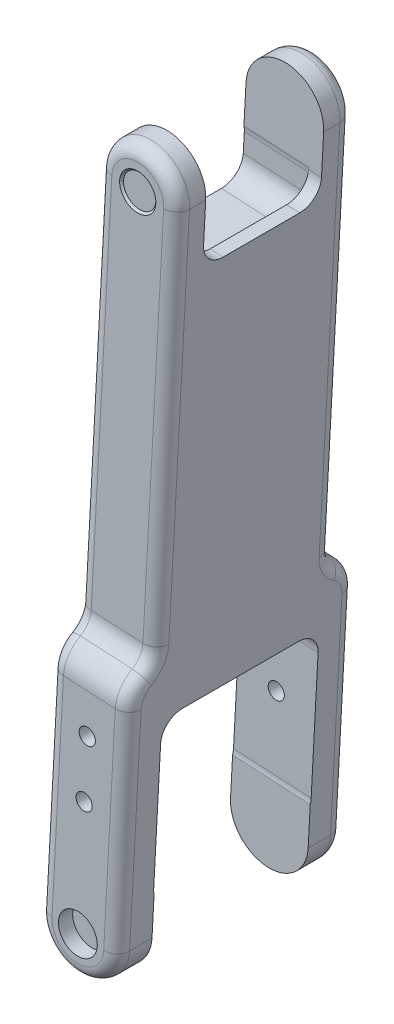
ISO-10303-21;
HEADER;
FILE_DESCRIPTION(('STEP AP214'),'2;1');
FILE_NAME('part.step','',(''),(''),'','','');
FILE_SCHEMA(('AUTOMOTIVE_DESIGN { 1 0 10303 214 1 1 1 1 }'));
ENDSEC;
DATA;
#1=APPLICATION_CONTEXT('core data for automotive mechanical design processes');
#2=APPLICATION_PROTOCOL_DEFINITION('international standard','automotive_design',2000,#1);
#3=PRODUCT_CONTEXT('',#1,'mechanical');
#4=PRODUCT('Part','Part','',(#3));
#5=PRODUCT_RELATED_PRODUCT_CATEGORY('part','',(#4));
#6=PRODUCT_DEFINITION_FORMATION('','',#4);
#7=PRODUCT_DEFINITION_CONTEXT('part definition',#1,'design');
#8=PRODUCT_DEFINITION('design','',#6,#7);
#9=PRODUCT_DEFINITION_SHAPE('','',#8);
#10=(LENGTH_UNIT() NAMED_UNIT(*) SI_UNIT(.MILLI.,.METRE.));
#11=(NAMED_UNIT(*) PLANE_ANGLE_UNIT() SI_UNIT($,.RADIAN.));
#12=(NAMED_UNIT(*) SI_UNIT($,.STERADIAN.) SOLID_ANGLE_UNIT());
#13=UNCERTAINTY_MEASURE_WITH_UNIT(LENGTH_MEASURE(1.E-05),#10,'distance_accuracy_value','');
#14=(GEOMETRIC_REPRESENTATION_CONTEXT(3) GLOBAL_UNCERTAINTY_ASSIGNED_CONTEXT((#13)) GLOBAL_UNIT_ASSIGNED_CONTEXT((#10,
#11,#12)) REPRESENTATION_CONTEXT('',''));
#15=CARTESIAN_POINT('',(0.,0.,0.));
#16=DIRECTION('',(0.,0.,1.));
#17=DIRECTION('',(1.,0.,0.));
#18=AXIS2_PLACEMENT_3D('',#15,#16,#17);
#19=CARTESIAN_POINT('',(-15.196431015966,61.5535371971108,15.3));
#20=DIRECTION('',(0.,0.,-1.));
#21=DIRECTION('',(-1.,0.,0.));
#22=AXIS2_PLACEMENT_3D('',#19,#20,#21);
#23=PLANE('',#22);
#24=CARTESIAN_POINT('',(-12.700000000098,61.42,15.3));
#25=DIRECTION('',(0.,0.,1.));
#26=DIRECTION('',(0.,-1.,0.));
#27=AXIS2_PLACEMENT_3D('',#24,#25,#26);
#28=CIRCLE('',#27,3.);
#29=CARTESIAN_POINT('',(-12.700000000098,58.42,15.3));
#30=VERTEX_POINT('',#29);
#31=EDGE_CURVE('E381',#30,#30,#28,.T.);
#32=ORIENTED_EDGE('',*,*,#31,.T.);
#33=EDGE_LOOP('',(#32));
#34=FACE_BOUND('',#33,.T.);
#35=ADVANCED_FACE('F17',(#34),#23,.F.);
#36=CARTESIAN_POINT('',(-7.35851211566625,161.277240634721,13.3000000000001));
#37=DIRECTION('',(0.,0.,-1.));
#38=DIRECTION('',(-1.,0.,0.));
#39=AXIS2_PLACEMENT_3D('',#36,#37,#38);
#40=PLANE('',#39);
#41=CARTESIAN_POINT('',(-7.35851211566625,161.277240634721,13.3000000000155));
#42=DIRECTION('',(0.,0.,1.));
#43=DIRECTION('',(1.,0.,0.));
#44=AXIS2_PLACEMENT_3D('',#41,#42,#43);
#45=CIRCLE('',#44,2.50000000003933);
#46=CARTESIAN_POINT('',(-4.86208109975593,161.143703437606,13.2999999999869));
#47=VERTEX_POINT('',#46);
#48=CARTESIAN_POINT('',(-9.85494313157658,161.410777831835,13.2999999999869));
#49=VERTEX_POINT('',#48);
#50=EDGE_CURVE('E373',#47,#49,#45,.T.);
#51=ORIENTED_EDGE('',*,*,#50,.T.);
#52=CARTESIAN_POINT('',(-7.35851211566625,161.277240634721,13.2999999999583));
#53=DIRECTION('',(0.,0.,1.));
#54=DIRECTION('',(1.,0.,0.));
#55=AXIS2_PLACEMENT_3D('',#52,#53,#54);
#56=CIRCLE('',#55,2.50000000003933);
#57=EDGE_CURVE('E379',#49,#47,#56,.T.);
#58=ORIENTED_EDGE('',*,*,#57,.T.);
#59=EDGE_LOOP('',(#51,#58));
#60=FACE_BOUND('',#59,.T.);
#61=ADVANCED_FACE('F378',(#60),#40,.F.);
#62=CARTESIAN_POINT('',(-7.35851211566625,161.277240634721,-13.2999999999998));
#63=DIRECTION('',(0.,0.,-1.));
#64=DIRECTION('',(-1.,0.,0.));
#65=AXIS2_PLACEMENT_3D('',#62,#63,#64);
#66=PLANE('',#65);
#67=CARTESIAN_POINT('',(-7.35851211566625,161.277240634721,-13.3000000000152));
#68=DIRECTION('',(0.,0.,-1.));
#69=DIRECTION('',(-1.,0.,0.));
#70=AXIS2_PLACEMENT_3D('',#67,#68,#69);
#71=CIRCLE('',#70,2.49999999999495);
#72=CARTESIAN_POINT('',(-9.8585121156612,161.277240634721,-13.3000000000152));
#73=VERTEX_POINT('',#72);
#74=EDGE_CURVE('E388',#73,#73,#71,.T.);
#75=ORIENTED_EDGE('',*,*,#74,.T.);
#76=EDGE_LOOP('',(#75));
#77=FACE_BOUND('',#76,.T.);
#78=ADVANCED_FACE('F2025',(#77),#66,.T.);
#79=CARTESIAN_POINT('',(-15.196431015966,61.5535371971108,-15.3));
#80=DIRECTION('',(0.,0.,1.));
#81=DIRECTION('',(1.,0.,0.));
#82=AXIS2_PLACEMENT_3D('',#79,#80,#81);
#83=PLANE('',#82);
#84=CARTESIAN_POINT('',(-12.700000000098,61.42,-15.3));
#85=DIRECTION('',(0.,0.,-1.));
#86=DIRECTION('',(0.,1.,0.));
#87=AXIS2_PLACEMENT_3D('',#84,#85,#86);
#88=CIRCLE('',#87,3.);
#89=CARTESIAN_POINT('',(-12.700000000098,64.42,-15.3));
#90=VERTEX_POINT('',#89);
#91=EDGE_CURVE('E832',#90,#90,#88,.T.);
#92=ORIENTED_EDGE('',*,*,#91,.T.);
#93=EDGE_LOOP('',(#92));
#94=FACE_BOUND('',#93,.T.);
#95=ADVANCED_FACE('F851',(#94),#83,.F.);
#96=CARTESIAN_POINT('',(-8.70571037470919,61.2063404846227,1.54076882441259E-13));
#97=DIRECTION('',(-0.998572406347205,0.0534148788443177,0.));
#98=DIRECTION('',(-0.0534148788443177,-0.998572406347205,0.));
#99=AXIS2_PLACEMENT_3D('',#96,#97,#98);
#100=PLANE('',#99);
#101=DIRECTION('',(0.,0.,1.));
#102=VECTOR('',#101,1.);
#103=CARTESIAN_POINT('',(-6.86289705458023,95.6570885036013,-9.09999999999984));
#104=LINE('',#103,#102);
#105=CARTESIAN_POINT('',(-6.86289705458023,95.6570885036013,-5.89999999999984));
#106=VERTEX_POINT('',#105);
#107=CARTESIAN_POINT('',(-6.86289705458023,95.6570885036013,5.90000000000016));
#108=VERTEX_POINT('',#107);
#109=EDGE_CURVE('E413',#106,#108,#104,.T.);
#110=ORIENTED_EDGE('',*,*,#109,.T.);
#111=CARTESIAN_POINT('',(-6.69196944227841,98.8525202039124,5.90000000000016));
#112=DIRECTION('',(0.998572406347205,-0.0534148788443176,0.));
#113=DIRECTION('',(0.0534148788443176,0.998572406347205,0.));
#114=AXIS2_PLACEMENT_3D('',#111,#112,#113);
#115=CIRCLE('',#114,3.2);
#116=CARTESIAN_POINT('',(-6.69196944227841,98.8525202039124,9.10000000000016));
#117=VERTEX_POINT('',#116);
#118=EDGE_CURVE('E829',#108,#117,#115,.F.);
#119=ORIENTED_EDGE('',*,*,#118,.T.);
#120=DIRECTION('',(0.0534148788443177,0.998572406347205,0.));
#121=VECTOR('',#120,1.);
#122=CARTESIAN_POINT('',(-6.69196944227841,98.8525202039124,9.10000000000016));
#123=LINE('',#122,#121);
#124=CARTESIAN_POINT('',(-4.4699104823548,140.393132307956,9.10000000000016));
#125=VERTEX_POINT('',#124);
#126=EDGE_CURVE('E1139',#117,#125,#123,.T.);
#127=ORIENTED_EDGE('',*,*,#126,.T.);
#128=CARTESIAN_POINT('',(-4.4699104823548,140.393132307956,5.90000000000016));
#129=DIRECTION('',(0.998572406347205,-0.0534148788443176,0.));
#130=DIRECTION('',(0.0534148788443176,0.998572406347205,0.));
#131=AXIS2_PLACEMENT_3D('',#128,#129,#130);
#132=CIRCLE('',#131,3.2);
#133=CARTESIAN_POINT('',(-4.29898287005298,143.588564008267,5.90000000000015));
#134=VERTEX_POINT('',#133);
#135=EDGE_CURVE('E825',#125,#134,#132,.F.);
#136=ORIENTED_EDGE('',*,*,#135,.T.);
#137=DIRECTION('',(0.,0.,1.));
#138=VECTOR('',#137,1.);
#139=CARTESIAN_POINT('',(-4.29898287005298,143.588564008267,-9.09999999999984));
#140=LINE('',#139,#138);
#141=CARTESIAN_POINT('',(-4.29898287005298,143.588564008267,-5.89999999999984));
#142=VERTEX_POINT('',#141);
#143=EDGE_CURVE('E1144',#134,#142,#140,.F.);
#144=ORIENTED_EDGE('',*,*,#143,.T.);
#145=CARTESIAN_POINT('',(-4.46991048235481,140.393132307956,-5.89999999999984));
#146=DIRECTION('',(0.998572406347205,-0.0534148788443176,0.));
#147=DIRECTION('',(0.0534148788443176,0.998572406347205,0.));
#148=AXIS2_PLACEMENT_3D('',#145,#146,#147);
#149=CIRCLE('',#148,3.2);
#150=CARTESIAN_POINT('',(-4.4699104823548,140.393132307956,-9.09999999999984));
#151=VERTEX_POINT('',#150);
#152=EDGE_CURVE('E821',#142,#151,#149,.F.);
#153=ORIENTED_EDGE('',*,*,#152,.T.);
#154=DIRECTION('',(-0.0534148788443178,-0.998572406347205,0.));
#155=VECTOR('',#154,1.);
#156=CARTESIAN_POINT('',(-4.4699104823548,140.393132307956,-9.09999999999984));
#157=LINE('',#156,#155);
#158=CARTESIAN_POINT('',(-6.69196944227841,98.8525202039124,-9.09999999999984));
#159=VERTEX_POINT('',#158);
#160=EDGE_CURVE('E1149',#151,#159,#157,.T.);
#161=ORIENTED_EDGE('',*,*,#160,.T.);
#162=CARTESIAN_POINT('',(-6.69196944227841,98.8525202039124,-5.89999999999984));
#163=DIRECTION('',(0.998572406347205,-0.0534148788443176,0.));
#164=DIRECTION('',(0.0534148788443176,0.998572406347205,0.));
#165=AXIS2_PLACEMENT_3D('',#162,#163,#164);
#166=CIRCLE('',#165,3.2);
#167=EDGE_CURVE('E817',#159,#106,#166,.F.);
#168=ORIENTED_EDGE('',*,*,#167,.T.);
#169=EDGE_LOOP('',(#110,#119,#127,#136,#144,#153,#161,#168));
#170=FACE_BOUND('',#169,.T.);
#171=ADVANCED_FACE('F843',(#170),#100,.T.);
#172=CARTESIAN_POINT('',(-12.700000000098,61.42,17.5));
#173=DIRECTION('',(0.,0.,1.));
#174=DIRECTION('',(0.,-1.,0.));
#175=AXIS2_PLACEMENT_3D('',#172,#173,#174);
#176=CYLINDRICAL_SURFACE('',#175,3.);
#177=ORIENTED_EDGE('',*,*,#31,.F.);
#178=EDGE_LOOP('',(#177));
#179=FACE_BOUND('',#178,.T.);
#180=CARTESIAN_POINT('',(-12.700000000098,61.42,17.5));
#181=DIRECTION('',(0.,0.,1.));
#182=DIRECTION('',(0.,-1.,0.));
#183=AXIS2_PLACEMENT_3D('',#180,#181,#182);
#184=CIRCLE('',#183,3.);
#185=CARTESIAN_POINT('',(-12.700000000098,58.42,17.5));
#186=VERTEX_POINT('',#185);
#187=EDGE_CURVE('E800',#186,#186,#184,.T.);
#188=ORIENTED_EDGE('',*,*,#187,.T.);
#189=EDGE_LOOP('',(#188));
#190=FACE_BOUND('',#189,.T.);
#191=ADVANCED_FACE('F841',(#179,#190),#176,.F.);
#192=CARTESIAN_POINT('',(-7.35851211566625,161.277240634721,13.5999999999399));
#193=DIRECTION('',(0.,0.,1.));
#194=DIRECTION('',(1.,0.,0.));
#195=AXIS2_PLACEMENT_3D('',#192,#193,#194);
#196=CONICAL_SURFACE('',#195,2.80000000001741,0.785398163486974);
#197=ORIENTED_EDGE('',*,*,#50,.F.);
#198=DIRECTION('',(-0.706097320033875,0.0377700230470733,-0.707106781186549));
#199=VECTOR('',#198,1.);
#200=CARTESIAN_POINT('',(498269.487673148,-26492.1704219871,499000.));
#201=LINE('',#200,#199);
#202=CARTESIAN_POINT('',(-4.5625093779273,161.127678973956,13.5999999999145));
#203=VERTEX_POINT('',#202);
#204=EDGE_CURVE('E380',#47,#203,#201,.F.);
#205=ORIENTED_EDGE('',*,*,#204,.T.);
#206=CARTESIAN_POINT('',(-7.35851211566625,161.277240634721,13.5999999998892));
#207=DIRECTION('',(0.,0.,1.));
#208=DIRECTION('',(1.,0.,0.));
#209=AXIS2_PLACEMENT_3D('',#206,#207,#208);
#210=CIRCLE('',#209,2.79999999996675);
#211=CARTESIAN_POINT('',(-10.1545148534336,161.426802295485,13.5999999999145));
#212=VERTEX_POINT('',#211);
#213=EDGE_CURVE('E392',#203,#212,#210,.T.);
#214=ORIENTED_EDGE('',*,*,#213,.T.);
#215=DIRECTION('',(0.706097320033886,-0.0377700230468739,-0.707106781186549));
#216=VECTOR('',#215,1.);
#217=CARTESIAN_POINT('',(-498284.204697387,26814.7249031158,499000.));
#218=LINE('',#217,#216);
#219=EDGE_CURVE('E386',#212,#49,#218,.T.);
#220=ORIENTED_EDGE('',*,*,#219,.T.);
#221=EDGE_LOOP('',(#197,#205,#214,#220));
#222=FACE_BOUND('',#221,.T.);
#223=ADVANCED_FACE('F391',(#222),#196,.F.);
#224=CARTESIAN_POINT('',(-7.35851211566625,161.277240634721,13.5999999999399));
#225=DIRECTION('',(0.,0.,1.));
#226=DIRECTION('',(1.,0.,0.));
#227=AXIS2_PLACEMENT_3D('',#224,#225,#226);
#228=CONICAL_SURFACE('',#227,2.80000000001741,0.785398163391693);
#229=ORIENTED_EDGE('',*,*,#219,.F.);
#230=CARTESIAN_POINT('',(-7.35851211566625,161.277240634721,13.5999999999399));
#231=DIRECTION('',(0.,0.,1.));
#232=DIRECTION('',(1.,0.,0.));
#233=AXIS2_PLACEMENT_3D('',#230,#231,#232);
#234=CIRCLE('',#233,2.80000000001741);
#235=EDGE_CURVE('E756',#212,#203,#234,.T.);
#236=ORIENTED_EDGE('',*,*,#235,.T.);
#237=ORIENTED_EDGE('',*,*,#204,.F.);
#238=ORIENTED_EDGE('',*,*,#57,.F.);
#239=EDGE_LOOP('',(#229,#236,#237,#238));
#240=FACE_BOUND('',#239,.T.);
#241=ADVANCED_FACE('F384',(#240),#228,.F.);
#242=CARTESIAN_POINT('',(-7.35851211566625,161.277240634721,-13.5999999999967));
#243=DIRECTION('',(0.,0.,-1.));
#244=DIRECTION('',(-1.,0.,0.));
#245=AXIS2_PLACEMENT_3D('',#242,#243,#244);
#246=CONICAL_SURFACE('',#245,2.79999999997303,0.785398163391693);
#247=ORIENTED_EDGE('',*,*,#74,.F.);
#248=EDGE_LOOP('',(#247));
#249=FACE_BOUND('',#248,.T.);
#250=CARTESIAN_POINT('',(-7.35851211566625,161.277240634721,-13.5999999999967));
#251=DIRECTION('',(0.,0.,-1.));
#252=DIRECTION('',(-1.,0.,0.));
#253=AXIS2_PLACEMENT_3D('',#250,#251,#252);
#254=CIRCLE('',#253,2.79999999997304);
#255=CARTESIAN_POINT('',(-10.1585121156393,161.277240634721,-13.5999999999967));
#256=VERTEX_POINT('',#255);
#257=EDGE_CURVE('E680',#256,#256,#254,.T.);
#258=ORIENTED_EDGE('',*,*,#257,.T.);
#259=EDGE_LOOP('',(#258));
#260=FACE_BOUND('',#259,.T.);
#261=ADVANCED_FACE('F1982',(#249,#260),#246,.F.);
#262=CARTESIAN_POINT('',(-12.700000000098,61.42,-17.5));
#263=DIRECTION('',(0.,0.,-1.));
#264=DIRECTION('',(0.,1.,0.));
#265=AXIS2_PLACEMENT_3D('',#262,#263,#264);
#266=CYLINDRICAL_SURFACE('',#265,3.);
#267=CARTESIAN_POINT('',(-12.700000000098,61.42,-17.5));
#268=DIRECTION('',(0.,0.,-1.));
#269=DIRECTION('',(0.,1.,0.));
#270=AXIS2_PLACEMENT_3D('',#267,#268,#269);
#271=CIRCLE('',#270,3.);
#272=CARTESIAN_POINT('',(-12.700000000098,64.42,-17.5));
#273=VERTEX_POINT('',#272);
#274=EDGE_CURVE('E1136',#273,#273,#271,.F.);
#275=ORIENTED_EDGE('',*,*,#274,.F.);
#276=EDGE_LOOP('',(#275));
#277=FACE_BOUND('',#276,.T.);
#278=ORIENTED_EDGE('',*,*,#91,.F.);
#279=EDGE_LOOP('',(#278));
#280=FACE_BOUND('',#279,.T.);
#281=ADVANCED_FACE('F1973',(#277,#280),#266,.F.);
#282=CARTESIAN_POINT('',(-6.69196944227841,98.8525202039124,5.90000000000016));
#283=DIRECTION('',(0.998572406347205,-0.0534148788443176,0.));
#284=DIRECTION('',(0.0534148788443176,0.998572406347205,0.));
#285=AXIS2_PLACEMENT_3D('',#282,#283,#284);
#286=CYLINDRICAL_SURFACE('',#285,3.2);
#287=DIRECTION('',(0.998572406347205,-0.0534148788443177,0.));
#288=VECTOR('',#287,1.);
#289=CARTESIAN_POINT('',(-6.86289705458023,95.6570885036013,5.90000000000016));
#290=LINE('',#289,#288);
#291=CARTESIAN_POINT('',(-16.8486211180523,96.1912372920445,5.90000000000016));
#292=VERTEX_POINT('',#291);
#293=EDGE_CURVE('E819',#108,#292,#290,.F.);
#294=ORIENTED_EDGE('',*,*,#293,.T.);
#295=CARTESIAN_POINT('',(-16.6776935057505,99.3866689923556,5.90000000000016));
#296=DIRECTION('',(0.998572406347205,-0.0534148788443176,0.));
#297=DIRECTION('',(0.0534148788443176,0.998572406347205,0.));
#298=AXIS2_PLACEMENT_3D('',#295,#296,#297);
#299=CIRCLE('',#298,3.2);
#300=CARTESIAN_POINT('',(-16.6776935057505,99.3866689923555,9.10000000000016));
#301=VERTEX_POINT('',#300);
#302=EDGE_CURVE('E599',#292,#301,#299,.F.);
#303=ORIENTED_EDGE('',*,*,#302,.T.);
#304=DIRECTION('',(0.998572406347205,-0.0534148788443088,0.));
#305=VECTOR('',#304,1.);
#306=CARTESIAN_POINT('',(-16.6776935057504,99.3866689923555,9.10000000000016));
#307=LINE('',#306,#305);
#308=EDGE_CURVE('E831',#301,#117,#307,.T.);
#309=ORIENTED_EDGE('',*,*,#308,.T.);
#310=ORIENTED_EDGE('',*,*,#118,.F.);
#311=EDGE_LOOP('',(#294,#303,#309,#310));
#312=FACE_BOUND('',#311,.T.);
#313=ADVANCED_FACE('F1554',(#312),#286,.F.);
#314=CARTESIAN_POINT('',(-4.29898287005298,143.588564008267,9.10000000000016));
#315=DIRECTION('',(0.,0.,1.));
#316=DIRECTION('',(1.,0.,0.));
#317=AXIS2_PLACEMENT_3D('',#314,#315,#316);
#318=PLANE('',#317);
#319=DIRECTION('',(0.998572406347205,-0.0534148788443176,0.));
#320=VECTOR('',#319,1.);
#321=CARTESIAN_POINT('',(-4.4699104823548,140.393132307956,9.10000000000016));
#322=LINE('',#321,#320);
#323=CARTESIAN_POINT('',(-14.4556345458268,140.927281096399,9.10000000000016));
#324=VERTEX_POINT('',#323);
#325=EDGE_CURVE('E828',#324,#125,#322,.T.);
#326=ORIENTED_EDGE('',*,*,#325,.T.);
#327=ORIENTED_EDGE('',*,*,#126,.F.);
#328=ORIENTED_EDGE('',*,*,#308,.F.);
#329=DIRECTION('',(0.0534148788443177,0.998572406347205,0.));
#330=VECTOR('',#329,1.);
#331=CARTESIAN_POINT('',(-13.3499465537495,161.597729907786,9.10000000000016));
#332=LINE('',#331,#330);
#333=EDGE_CURVE('E596',#301,#324,#332,.T.);
#334=ORIENTED_EDGE('',*,*,#333,.T.);
#335=EDGE_LOOP('',(#326,#327,#328,#334));
#336=FACE_BOUND('',#335,.T.);
#337=ADVANCED_FACE('F1551',(#336),#318,.F.);
#338=CARTESIAN_POINT('',(-4.4699104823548,140.393132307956,5.90000000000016));
#339=DIRECTION('',(0.998572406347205,-0.0534148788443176,0.));
#340=DIRECTION('',(0.0534148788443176,0.998572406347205,0.));
#341=AXIS2_PLACEMENT_3D('',#338,#339,#340);
#342=CYLINDRICAL_SURFACE('',#341,3.2);
#343=ORIENTED_EDGE('',*,*,#325,.F.);
#344=CARTESIAN_POINT('',(-14.4556345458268,140.927281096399,5.90000000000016));
#345=DIRECTION('',(0.998572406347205,-0.0534148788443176,0.));
#346=DIRECTION('',(0.0534148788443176,0.998572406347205,0.));
#347=AXIS2_PLACEMENT_3D('',#344,#345,#346);
#348=CIRCLE('',#347,3.2);
#349=CARTESIAN_POINT('',(-14.284706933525,144.12271279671,5.90000000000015));
#350=VERTEX_POINT('',#349);
#351=EDGE_CURVE('E595',#324,#350,#348,.F.);
#352=ORIENTED_EDGE('',*,*,#351,.T.);
#353=DIRECTION('',(-0.998572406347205,0.0534148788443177,0.));
#354=VECTOR('',#353,1.);
#355=CARTESIAN_POINT('',(-4.29898287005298,143.588564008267,5.90000000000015));
#356=LINE('',#355,#354);
#357=EDGE_CURVE('E827',#350,#134,#356,.F.);
#358=ORIENTED_EDGE('',*,*,#357,.T.);
#359=ORIENTED_EDGE('',*,*,#135,.F.);
#360=EDGE_LOOP('',(#343,#352,#358,#359));
#361=FACE_BOUND('',#360,.T.);
#362=ADVANCED_FACE('F1543',(#361),#342,.F.);
#363=CARTESIAN_POINT('',(-4.29898287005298,143.588564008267,-9.09999999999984));
#364=DIRECTION('',(0.0534148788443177,0.998572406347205,0.));
#365=DIRECTION('',(-0.998572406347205,0.0534148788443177,0.));
#366=AXIS2_PLACEMENT_3D('',#363,#364,#365);
#367=PLANE('',#366);
#368=ORIENTED_EDGE('',*,*,#357,.F.);
#369=DIRECTION('',(0.,0.,1.));
#370=VECTOR('',#369,1.);
#371=CARTESIAN_POINT('',(-14.284706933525,144.12271279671,-17.5));
#372=LINE('',#371,#370);
#373=CARTESIAN_POINT('',(-14.284706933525,144.12271279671,-5.89999999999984));
#374=VERTEX_POINT('',#373);
#375=EDGE_CURVE('E592',#350,#374,#372,.F.);
#376=ORIENTED_EDGE('',*,*,#375,.T.);
#377=DIRECTION('',(0.998572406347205,-0.0534148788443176,0.));
#378=VECTOR('',#377,1.);
#379=CARTESIAN_POINT('',(-4.29898287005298,143.588564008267,-5.89999999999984));
#380=LINE('',#379,#378);
#381=EDGE_CURVE('E824',#374,#142,#380,.T.);
#382=ORIENTED_EDGE('',*,*,#381,.T.);
#383=ORIENTED_EDGE('',*,*,#143,.F.);
#384=EDGE_LOOP('',(#368,#376,#382,#383));
#385=FACE_BOUND('',#384,.T.);
#386=ADVANCED_FACE('F1938',(#385),#367,.F.);
#387=CARTESIAN_POINT('',(-4.4699104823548,140.393132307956,-5.89999999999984));
#388=DIRECTION('',(0.998572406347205,-0.0534148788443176,0.));
#389=DIRECTION('',(0.0534148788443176,0.998572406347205,0.));
#390=AXIS2_PLACEMENT_3D('',#387,#388,#389);
#391=CYLINDRICAL_SURFACE('',#390,3.2);
#392=ORIENTED_EDGE('',*,*,#381,.F.);
#393=CARTESIAN_POINT('',(-14.4556345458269,140.927281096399,-5.89999999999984));
#394=DIRECTION('',(0.998572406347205,-0.0534148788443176,0.));
#395=DIRECTION('',(0.0534148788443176,0.998572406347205,0.));
#396=AXIS2_PLACEMENT_3D('',#393,#394,#395);
#397=CIRCLE('',#396,3.2);
#398=CARTESIAN_POINT('',(-14.4556345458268,140.927281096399,-9.09999999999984));
#399=VERTEX_POINT('',#398);
#400=EDGE_CURVE('E591',#374,#399,#397,.F.);
#401=ORIENTED_EDGE('',*,*,#400,.T.);
#402=DIRECTION('',(0.998572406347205,-0.0534148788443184,0.));
#403=VECTOR('',#402,1.);
#404=CARTESIAN_POINT('',(-14.4556345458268,140.927281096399,-9.09999999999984));
#405=LINE('',#404,#403);
#406=EDGE_CURVE('E823',#399,#151,#405,.T.);
#407=ORIENTED_EDGE('',*,*,#406,.T.);
#408=ORIENTED_EDGE('',*,*,#152,.F.);
#409=EDGE_LOOP('',(#392,#401,#407,#408));
#410=FACE_BOUND('',#409,.T.);
#411=ADVANCED_FACE('F1928',(#410),#391,.F.);
#412=CARTESIAN_POINT('',(-4.29898287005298,143.588564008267,-9.09999999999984));
#413=DIRECTION('',(0.,0.,-1.));
#414=DIRECTION('',(-1.,0.,0.));
#415=AXIS2_PLACEMENT_3D('',#412,#413,#414);
#416=PLANE('',#415);
#417=ORIENTED_EDGE('',*,*,#406,.F.);
#418=DIRECTION('',(0.0534148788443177,0.998572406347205,0.));
#419=VECTOR('',#418,1.);
#420=CARTESIAN_POINT('',(-13.3499465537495,161.597729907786,-9.09999999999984));
#421=LINE('',#420,#419);
#422=CARTESIAN_POINT('',(-16.6776935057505,99.3866689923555,-9.09999999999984));
#423=VERTEX_POINT('',#422);
#424=EDGE_CURVE('E588',#399,#423,#421,.F.);
#425=ORIENTED_EDGE('',*,*,#424,.T.);
#426=DIRECTION('',(0.998572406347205,-0.0534148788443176,0.));
#427=VECTOR('',#426,1.);
#428=CARTESIAN_POINT('',(-6.69196944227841,98.8525202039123,-9.09999999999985));
#429=LINE('',#428,#427);
#430=EDGE_CURVE('E820',#423,#159,#429,.T.);
#431=ORIENTED_EDGE('',*,*,#430,.T.);
#432=ORIENTED_EDGE('',*,*,#160,.F.);
#433=EDGE_LOOP('',(#417,#425,#431,#432));
#434=FACE_BOUND('',#433,.T.);
#435=ADVANCED_FACE('F1919',(#434),#416,.F.);
#436=CARTESIAN_POINT('',(-6.69196944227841,98.8525202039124,-5.89999999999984));
#437=DIRECTION('',(0.998572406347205,-0.0534148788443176,0.));
#438=DIRECTION('',(0.0534148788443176,0.998572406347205,0.));
#439=AXIS2_PLACEMENT_3D('',#436,#437,#438);
#440=CYLINDRICAL_SURFACE('',#439,3.2);
#441=ORIENTED_EDGE('',*,*,#430,.F.);
#442=CARTESIAN_POINT('',(-16.6776935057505,99.3866689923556,-5.89999999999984));
#443=DIRECTION('',(0.998572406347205,-0.0534148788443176,0.));
#444=DIRECTION('',(0.0534148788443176,0.998572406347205,0.));
#445=AXIS2_PLACEMENT_3D('',#442,#443,#444);
#446=CIRCLE('',#445,3.2);
#447=CARTESIAN_POINT('',(-16.8486211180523,96.1912372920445,-5.89999999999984));
#448=VERTEX_POINT('',#447);
#449=EDGE_CURVE('E587',#423,#448,#446,.F.);
#450=ORIENTED_EDGE('',*,*,#449,.T.);
#451=DIRECTION('',(0.998572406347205,-0.0534148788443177,0.));
#452=VECTOR('',#451,1.);
#453=CARTESIAN_POINT('',(-6.86289705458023,95.6570885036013,-5.89999999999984));
#454=LINE('',#453,#452);
#455=EDGE_CURVE('E1154',#448,#106,#454,.T.);
#456=ORIENTED_EDGE('',*,*,#455,.T.);
#457=ORIENTED_EDGE('',*,*,#167,.F.);
#458=EDGE_LOOP('',(#441,#450,#456,#457));
#459=FACE_BOUND('',#458,.T.);
#460=ADVANCED_FACE('F1910',(#459),#440,.F.);
#461=CARTESIAN_POINT('',(-6.86289705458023,95.6570885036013,-9.09999999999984));
#462=DIRECTION('',(-0.0534148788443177,-0.998572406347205,0.));
#463=DIRECTION('',(0.998572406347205,-0.0534148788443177,0.));
#464=AXIS2_PLACEMENT_3D('',#461,#462,#463);
#465=PLANE('',#464);
#466=ORIENTED_EDGE('',*,*,#455,.F.);
#467=DIRECTION('',(0.,0.,1.));
#468=VECTOR('',#467,1.);
#469=CARTESIAN_POINT('',(-16.8486211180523,96.1912372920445,-17.5));
#470=LINE('',#469,#468);
#471=EDGE_CURVE('E584',#448,#292,#470,.T.);
#472=ORIENTED_EDGE('',*,*,#471,.T.);
#473=ORIENTED_EDGE('',*,*,#293,.F.);
#474=ORIENTED_EDGE('',*,*,#109,.F.);
#475=EDGE_LOOP('',(#466,#472,#473,#474));
#476=FACE_BOUND('',#475,.T.);
#477=ADVANCED_FACE('F1173',(#476),#465,.F.);
#478=CARTESIAN_POINT('',(-14.5470114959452,101.776270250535,-16.8));
#479=DIRECTION('',(0.998572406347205,-0.0534148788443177,0.));
#480=DIRECTION('',(-0.0534148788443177,-0.998572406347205,0.));
#481=AXIS2_PLACEMENT_3D('',#478,#479,#480);
#482=TOROIDAL_SURFACE('',#481,5.2,2.);
#483=CARTESIAN_POINT('',(-14.5470114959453,101.776270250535,-11.5999999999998));
#484=DIRECTION('',(-0.0534148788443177,-0.998572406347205,0.));
#485=DIRECTION('',(0.998572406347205,-0.0534148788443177,0.));
#486=AXIS2_PLACEMENT_3D('',#483,#484,#485);
#487=CIRCLE('',#486,2.);
#488=CARTESIAN_POINT('',(-14.5470114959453,101.776270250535,-13.5999999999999));
#489=VERTEX_POINT('',#488);
#490=CARTESIAN_POINT('',(-16.5441563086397,101.883100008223,-11.5999999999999));
#491=VERTEX_POINT('',#490);
#492=EDGE_CURVE('E1180',#489,#491,#487,.F.);
#493=ORIENTED_EDGE('',*,*,#492,.F.);
#494=CARTESIAN_POINT('',(-14.5470114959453,101.776270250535,-16.8));
#495=DIRECTION('',(0.998572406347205,-0.0534148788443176,0.));
#496=DIRECTION('',(0.0534148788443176,0.998572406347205,0.));
#497=AXIS2_PLACEMENT_3D('',#494,#495,#496);
#498=CIRCLE('',#497,3.2);
#499=CARTESIAN_POINT('',(-14.6925526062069,99.0554302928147,-15.1219512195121));
#500=VERTEX_POINT('',#499);
#501=EDGE_CURVE('E1127',#489,#500,#498,.T.);
#502=ORIENTED_EDGE('',*,*,#501,.T.);
#503=CARTESIAN_POINT('',(-14.7835158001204,97.3549053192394,-14.0731707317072));
#504=DIRECTION('',(0.0280102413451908,0.523641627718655,0.851478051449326));
#505=DIRECTION('',(0.0454815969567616,0.850262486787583,-0.524390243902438));
#506=AXIS2_PLACEMENT_3D('',#503,#504,#505);
#507=CIRCLE('',#506,2.);
#508=CARTESIAN_POINT('',(-16.7806606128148,97.4617350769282,-14.0731707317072));
#509=VERTEX_POINT('',#508);
#510=EDGE_CURVE('E1245',#509,#500,#507,.F.);
#511=ORIENTED_EDGE('',*,*,#510,.F.);
#512=CARTESIAN_POINT('',(-16.5441563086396,101.883100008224,-16.8));
#513=DIRECTION('',(-0.998572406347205,0.0534148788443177,0.));
#514=DIRECTION('',(-0.0454815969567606,-0.850262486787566,0.524390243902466));
#515=AXIS2_PLACEMENT_3D('',#512,#513,#514);
#516=CIRCLE('',#515,5.20000000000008);
#517=EDGE_CURVE('E504',#509,#491,#516,.T.);
#518=ORIENTED_EDGE('',*,*,#517,.T.);
#519=EDGE_LOOP('',(#493,#502,#511,#518));
#520=FACE_BOUND('',#519,.T.);
#521=ADVANCED_FACE('F1162',(#520),#482,.T.);
#522=CARTESIAN_POINT('',(-11.3528017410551,161.490900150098,-11.5999999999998));
#523=DIRECTION('',(-0.0534148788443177,-0.998572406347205,0.));
#524=DIRECTION('',(0.998572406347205,-0.0534148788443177,0.));
#525=AXIS2_PLACEMENT_3D('',#522,#523,#524);
#526=CYLINDRICAL_SURFACE('',#525,2.);
#527=CARTESIAN_POINT('',(-11.352801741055,161.490900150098,-11.5999999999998));
#528=DIRECTION('',(-0.0534148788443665,-0.998572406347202,0.));
#529=DIRECTION('',(-0.998572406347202,0.0534148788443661,0.));
#530=AXIS2_PLACEMENT_3D('',#527,#528,#529);
#531=CIRCLE('',#530,2.);
#532=CARTESIAN_POINT('',(-11.3528017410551,161.490900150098,-13.5999999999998));
#533=VERTEX_POINT('',#532);
#534=CARTESIAN_POINT('',(-13.3499465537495,161.597729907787,-11.5999999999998));
#535=VERTEX_POINT('',#534);
#536=EDGE_CURVE('E1407',#533,#535,#531,.F.);
#537=ORIENTED_EDGE('',*,*,#536,.F.);
#538=DIRECTION('',(-0.0534148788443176,-0.998572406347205,0.));
#539=VECTOR('',#538,1.);
#540=CARTESIAN_POINT('',(-11.3528017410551,161.490900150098,-13.5999999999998));
#541=LINE('',#540,#539);
#542=EDGE_CURVE('E674',#533,#489,#541,.T.);
#543=ORIENTED_EDGE('',*,*,#542,.T.);
#544=ORIENTED_EDGE('',*,*,#492,.T.);
#545=DIRECTION('',(0.0534148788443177,0.998572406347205,0.));
#546=VECTOR('',#545,1.);
#547=CARTESIAN_POINT('',(-13.3499465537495,161.597729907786,-11.5999999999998));
#548=LINE('',#547,#546);
#549=EDGE_CURVE('E579',#491,#535,#548,.T.);
#550=ORIENTED_EDGE('',*,*,#549,.T.);
#551=EDGE_LOOP('',(#537,#543,#544,#550));
#552=FACE_BOUND('',#551,.T.);
#553=ADVANCED_FACE('F1172',(#552),#526,.T.);
#554=CARTESIAN_POINT('',(-1.68756695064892,154.965316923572,-9.19999999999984));
#555=DIRECTION('',(0.,0.,-1.));
#556=DIRECTION('',(0.,1.,0.));
#557=AXIS2_PLACEMENT_3D('',#554,#555,#556);
#558=PLANE('',#557);
#559=DIRECTION('',(-0.998572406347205,0.0534148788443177,0.));
#560=VECTOR('',#559,1.);
#561=CARTESIAN_POINT('',(-1.72996369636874,154.172724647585,-9.19999999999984));
#562=LINE('',#561,#560);
#563=CARTESIAN_POINT('',(-3.72710850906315,154.279554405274,-9.19999999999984));
#564=VERTEX_POINT('',#563);
#565=CARTESIAN_POINT('',(-13.7128325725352,154.813703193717,-9.19999999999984));
#566=VERTEX_POINT('',#565);
#567=EDGE_CURVE('E1183',#564,#566,#562,.T.);
#568=ORIENTED_EDGE('',*,*,#567,.T.);
#569=DIRECTION('',(0.0534148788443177,0.998572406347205,0.));
#570=VECTOR('',#569,1.);
#571=CARTESIAN_POINT('',(-13.3499465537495,161.597729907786,-9.19999999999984));
#572=LINE('',#571,#570);
#573=CARTESIAN_POINT('',(-13.8734123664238,151.811720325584,-9.19999999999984));
#574=VERTEX_POINT('',#573);
#575=EDGE_CURVE('E575',#566,#574,#572,.F.);
#576=ORIENTED_EDGE('',*,*,#575,.T.);
#577=DIRECTION('',(0.998572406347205,-0.0534148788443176,0.));
#578=VECTOR('',#577,1.);
#579=CARTESIAN_POINT('',(-1.89054349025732,151.170741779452,-9.19999999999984));
#580=LINE('',#579,#578);
#581=CARTESIAN_POINT('',(-3.88768830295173,151.277571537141,-9.19999999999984));
#582=VERTEX_POINT('',#581);
#583=EDGE_CURVE('E1182',#574,#582,#580,.T.);
#584=ORIENTED_EDGE('',*,*,#583,.T.);
#585=DIRECTION('',(0.0534148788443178,0.998572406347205,0.));
#586=VECTOR('',#585,1.);
#587=CARTESIAN_POINT('',(-8.7057103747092,61.2063404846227,-9.19999999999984));
#588=LINE('',#587,#586);
#589=EDGE_CURVE('E1417',#582,#564,#588,.T.);
#590=ORIENTED_EDGE('',*,*,#589,.T.);
#591=EDGE_LOOP('',(#568,#576,#584,#590));
#592=FACE_BOUND('',#591,.T.);
#593=ADVANCED_FACE('F1582',(#592),#558,.F.);
#594=CARTESIAN_POINT('',(-1.89054349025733,151.170741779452,-5.99999999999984));
#595=DIRECTION('',(0.998572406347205,-0.0534148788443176,0.));
#596=DIRECTION('',(0.0534148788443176,0.998572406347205,0.));
#597=AXIS2_PLACEMENT_3D('',#594,#595,#596);
#598=CYLINDRICAL_SURFACE('',#597,3.2);
#599=ORIENTED_EDGE('',*,*,#583,.F.);
#600=CARTESIAN_POINT('',(-13.8734123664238,151.811720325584,-5.99999999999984));
#601=DIRECTION('',(0.998572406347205,-0.0534148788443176,0.));
#602=DIRECTION('',(0.0534148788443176,0.998572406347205,0.));
#603=AXIS2_PLACEMENT_3D('',#600,#601,#602);
#604=CIRCLE('',#603,3.2);
#605=CARTESIAN_POINT('',(-14.0443399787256,148.616288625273,-5.99999999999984));
#606=VERTEX_POINT('',#605);
#607=EDGE_CURVE('E574',#574,#606,#604,.F.);
#608=ORIENTED_EDGE('',*,*,#607,.T.);
#609=DIRECTION('',(0.998572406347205,-0.0534148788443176,0.));
#610=VECTOR('',#609,1.);
#611=CARTESIAN_POINT('',(-2.06147110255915,147.975310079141,-5.99999999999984));
#612=LINE('',#611,#610);
#613=CARTESIAN_POINT('',(-4.05861591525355,148.08213983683,-5.99999999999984));
#614=VERTEX_POINT('',#613);
#615=EDGE_CURVE('E1188',#606,#614,#612,.T.);
#616=ORIENTED_EDGE('',*,*,#615,.T.);
#617=CARTESIAN_POINT('',(-3.88768830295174,151.277571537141,-5.99999999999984));
#618=DIRECTION('',(0.998572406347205,-0.0534148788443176,0.));
#619=DIRECTION('',(0.0534148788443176,0.998572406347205,0.));
#620=AXIS2_PLACEMENT_3D('',#617,#618,#619);
#621=CIRCLE('',#620,3.2);
#622=EDGE_CURVE('E1414',#614,#582,#621,.T.);
#623=ORIENTED_EDGE('',*,*,#622,.T.);
#624=EDGE_LOOP('',(#599,#608,#616,#623));
#625=FACE_BOUND('',#624,.T.);
#626=ADVANCED_FACE('F1576',(#625),#598,.F.);
#627=CARTESIAN_POINT('',(-2.06147110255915,147.975310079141,-9.09999999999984));
#628=DIRECTION('',(-0.0534148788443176,-0.998572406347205,0.));
#629=DIRECTION('',(0.998572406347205,-0.0534148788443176,0.));
#630=AXIS2_PLACEMENT_3D('',#627,#628,#629);
#631=PLANE('',#630);
#632=DIRECTION('',(0.998572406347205,-0.0534148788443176,0.));
#633=VECTOR('',#632,1.);
#634=CARTESIAN_POINT('',(-2.06147110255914,147.975310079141,6.00000000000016));
#635=LINE('',#634,#633);
#636=CARTESIAN_POINT('',(-14.0443399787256,148.616288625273,6.00000000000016));
#637=VERTEX_POINT('',#636);
#638=CARTESIAN_POINT('',(-4.05861591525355,148.08213983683,6.00000000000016));
#639=VERTEX_POINT('',#638);
#640=EDGE_CURVE('E1190',#637,#639,#635,.T.);
#641=ORIENTED_EDGE('',*,*,#640,.T.);
#642=DIRECTION('',(0.,0.,1.));
#643=VECTOR('',#642,1.);
#644=CARTESIAN_POINT('',(-4.05861591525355,148.08213983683,1.54076882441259E-13));
#645=LINE('',#644,#643);
#646=EDGE_CURVE('E1418',#639,#614,#645,.F.);
#647=ORIENTED_EDGE('',*,*,#646,.T.);
#648=ORIENTED_EDGE('',*,*,#615,.F.);
#649=DIRECTION('',(0.,0.,1.));
#650=VECTOR('',#649,1.);
#651=CARTESIAN_POINT('',(-14.0443399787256,148.616288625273,-17.5));
#652=LINE('',#651,#650);
#653=EDGE_CURVE('E571',#606,#637,#652,.T.);
#654=ORIENTED_EDGE('',*,*,#653,.T.);
#655=EDGE_LOOP('',(#641,#647,#648,#654));
#656=FACE_BOUND('',#655,.T.);
#657=ADVANCED_FACE('F1572',(#656),#631,.F.);
#658=CARTESIAN_POINT('',(-1.89054349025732,151.170741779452,6.00000000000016));
#659=DIRECTION('',(0.998572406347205,-0.0534148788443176,0.));
#660=DIRECTION('',(0.0534148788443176,0.998572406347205,0.));
#661=AXIS2_PLACEMENT_3D('',#658,#659,#660);
#662=CYLINDRICAL_SURFACE('',#661,3.2);
#663=ORIENTED_EDGE('',*,*,#640,.F.);
#664=CARTESIAN_POINT('',(-13.8734123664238,151.811720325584,6.00000000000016));
#665=DIRECTION('',(0.998572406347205,-0.0534148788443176,0.));
#666=DIRECTION('',(0.0534148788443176,0.998572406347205,0.));
#667=AXIS2_PLACEMENT_3D('',#664,#665,#666);
#668=CIRCLE('',#667,3.2);
#669=CARTESIAN_POINT('',(-13.8734123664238,151.811720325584,9.20000000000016));
#670=VERTEX_POINT('',#669);
#671=EDGE_CURVE('E570',#637,#670,#668,.F.);
#672=ORIENTED_EDGE('',*,*,#671,.T.);
#673=DIRECTION('',(0.998572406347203,-0.0534148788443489,0.));
#674=VECTOR('',#673,1.);
#675=CARTESIAN_POINT('',(-13.8734123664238,151.811720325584,9.20000000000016));
#676=LINE('',#675,#674);
#677=CARTESIAN_POINT('',(-3.88768830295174,151.277571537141,9.20000000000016));
#678=VERTEX_POINT('',#677);
#679=EDGE_CURVE('E1192',#670,#678,#676,.T.);
#680=ORIENTED_EDGE('',*,*,#679,.T.);
#681=CARTESIAN_POINT('',(-3.88768830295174,151.277571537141,6.00000000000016));
#682=DIRECTION('',(0.998572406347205,-0.0534148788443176,0.));
#683=DIRECTION('',(0.0534148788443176,0.998572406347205,0.));
#684=AXIS2_PLACEMENT_3D('',#681,#682,#683);
#685=CIRCLE('',#684,3.2);
#686=EDGE_CURVE('E1198',#678,#639,#685,.T.);
#687=ORIENTED_EDGE('',*,*,#686,.T.);
#688=EDGE_LOOP('',(#663,#672,#680,#687));
#689=FACE_BOUND('',#688,.T.);
#690=ADVANCED_FACE('F1567',(#689),#662,.F.);
#691=CARTESIAN_POINT('',(-1.68756695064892,154.965316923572,9.20000000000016));
#692=DIRECTION('',(0.,0.,1.));
#693=DIRECTION('',(0.,-1.,0.));
#694=AXIS2_PLACEMENT_3D('',#691,#692,#693);
#695=PLANE('',#694);
#696=DIRECTION('',(0.998572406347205,-0.0534148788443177,0.));
#697=VECTOR('',#696,1.);
#698=CARTESIAN_POINT('',(-1.72996369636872,154.172724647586,9.20000000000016));
#699=LINE('',#698,#697);
#700=CARTESIAN_POINT('',(-13.7128325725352,154.813703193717,9.20000000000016));
#701=VERTEX_POINT('',#700);
#702=CARTESIAN_POINT('',(-3.72710850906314,154.279554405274,9.20000000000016));
#703=VERTEX_POINT('',#702);
#704=EDGE_CURVE('E1196',#701,#703,#699,.T.);
#705=ORIENTED_EDGE('',*,*,#704,.T.);
#706=DIRECTION('',(0.0534148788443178,0.998572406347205,0.));
#707=VECTOR('',#706,1.);
#708=CARTESIAN_POINT('',(-8.7057103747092,61.2063404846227,9.20000000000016));
#709=LINE('',#708,#707);
#710=EDGE_CURVE('E1186',#703,#678,#709,.F.);
#711=ORIENTED_EDGE('',*,*,#710,.T.);
#712=ORIENTED_EDGE('',*,*,#679,.F.);
#713=DIRECTION('',(0.0534148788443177,0.998572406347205,0.));
#714=VECTOR('',#713,1.);
#715=CARTESIAN_POINT('',(-13.3499465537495,161.597729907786,9.20000000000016));
#716=LINE('',#715,#714);
#717=EDGE_CURVE('E567',#670,#701,#716,.T.);
#718=ORIENTED_EDGE('',*,*,#717,.T.);
#719=EDGE_LOOP('',(#705,#711,#712,#718));
#720=FACE_BOUND('',#719,.T.);
#721=ADVANCED_FACE('F1850',(#720),#695,.F.);
#722=CARTESIAN_POINT('',(-11.3528017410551,161.490900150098,11.6000000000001));
#723=DIRECTION('',(0.0534148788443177,0.998572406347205,0.));
#724=DIRECTION('',(-0.998572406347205,0.0534148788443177,0.));
#725=AXIS2_PLACEMENT_3D('',#722,#723,#724);
#726=CYLINDRICAL_SURFACE('',#725,2.);
#727=CARTESIAN_POINT('',(-11.352801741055,161.490900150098,11.6000000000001));
#728=DIRECTION('',(0.0534148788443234,0.998572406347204,0.));
#729=DIRECTION('',(-0.998572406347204,0.053414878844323,0.));
#730=AXIS2_PLACEMENT_3D('',#727,#728,#729);
#731=CIRCLE('',#730,2.);
#732=CARTESIAN_POINT('',(-13.3499465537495,161.597729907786,11.6000000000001));
#733=VERTEX_POINT('',#732);
#734=CARTESIAN_POINT('',(-11.3528017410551,161.490900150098,13.6000000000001));
#735=VERTEX_POINT('',#734);
#736=EDGE_CURVE('E725',#733,#735,#731,.T.);
#737=ORIENTED_EDGE('',*,*,#736,.F.);
#738=DIRECTION('',(0.0534148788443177,0.998572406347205,0.));
#739=VECTOR('',#738,1.);
#740=CARTESIAN_POINT('',(-13.3499465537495,161.597729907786,11.6000000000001));
#741=LINE('',#740,#739);
#742=CARTESIAN_POINT('',(-16.5441563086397,101.883100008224,11.6000000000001));
#743=VERTEX_POINT('',#742);
#744=EDGE_CURVE('E562',#733,#743,#741,.F.);
#745=ORIENTED_EDGE('',*,*,#744,.T.);
#746=CARTESIAN_POINT('',(-14.5470114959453,101.776270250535,11.6));
#747=DIRECTION('',(0.0534148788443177,0.998572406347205,0.));
#748=DIRECTION('',(0.,0.,-1.));
#749=AXIS2_PLACEMENT_3D('',#746,#747,#748);
#750=CIRCLE('',#749,2.);
#751=CARTESIAN_POINT('',(-14.5470114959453,101.776270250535,13.6000000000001));
#752=VERTEX_POINT('',#751);
#753=EDGE_CURVE('E1195',#752,#743,#750,.F.);
#754=ORIENTED_EDGE('',*,*,#753,.F.);
#755=DIRECTION('',(0.0534148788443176,0.998572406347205,0.));
#756=VECTOR('',#755,1.);
#757=CARTESIAN_POINT('',(-14.5470114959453,101.776270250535,13.6000000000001));
#758=LINE('',#757,#756);
#759=EDGE_CURVE('E727',#752,#735,#758,.T.);
#760=ORIENTED_EDGE('',*,*,#759,.T.);
#761=EDGE_LOOP('',(#737,#745,#754,#760));
#762=FACE_BOUND('',#761,.T.);
#763=ADVANCED_FACE('F1219',(#762),#726,.T.);
#764=CARTESIAN_POINT('',(-14.5470114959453,101.776270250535,16.8));
#765=DIRECTION('',(0.998572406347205,-0.0534148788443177,0.));
#766=DIRECTION('',(-0.0534148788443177,-0.998572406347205,0.));
#767=AXIS2_PLACEMENT_3D('',#764,#765,#766);
#768=TOROIDAL_SURFACE('',#767,5.2,2.);
#769=ORIENTED_EDGE('',*,*,#753,.T.);
#770=CARTESIAN_POINT('',(-16.5441563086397,101.883100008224,16.8));
#771=DIRECTION('',(-0.998572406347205,0.0534148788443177,0.));
#772=DIRECTION('',(0.,0.,-1.));
#773=AXIS2_PLACEMENT_3D('',#770,#771,#772);
#774=CIRCLE('',#773,5.19999999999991);
#775=CARTESIAN_POINT('',(-16.7806606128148,97.4617350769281,14.0731707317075));
#776=VERTEX_POINT('',#775);
#777=EDGE_CURVE('E518',#743,#776,#774,.T.);
#778=ORIENTED_EDGE('',*,*,#777,.T.);
#779=CARTESIAN_POINT('',(-14.7835158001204,97.3549053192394,14.0731707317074));
#780=DIRECTION('',(-0.0280102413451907,-0.52364162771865,0.85147805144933));
#781=DIRECTION('',(0.0454815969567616,0.850262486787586,0.524390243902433));
#782=AXIS2_PLACEMENT_3D('',#779,#780,#781);
#783=CIRCLE('',#782,2.);
#784=CARTESIAN_POINT('',(-14.6925526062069,99.0554302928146,15.1219512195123));
#785=VERTEX_POINT('',#784);
#786=EDGE_CURVE('E1202',#785,#776,#783,.T.);
#787=ORIENTED_EDGE('',*,*,#786,.F.);
#788=CARTESIAN_POINT('',(-14.5470114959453,101.776270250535,16.8));
#789=DIRECTION('',(0.998572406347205,-0.0534148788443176,0.));
#790=DIRECTION('',(0.0534148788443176,0.998572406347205,0.));
#791=AXIS2_PLACEMENT_3D('',#788,#789,#790);
#792=CIRCLE('',#791,3.2);
#793=EDGE_CURVE('E703',#785,#752,#792,.T.);
#794=ORIENTED_EDGE('',*,*,#793,.T.);
#795=EDGE_LOOP('',(#769,#778,#787,#794));
#796=FACE_BOUND('',#795,.T.);
#797=ADVANCED_FACE('F1208',(#796),#768,.T.);
#798=CARTESIAN_POINT('',(-14.9199605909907,94.8041178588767,12.5000000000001));
#799=DIRECTION('',(0.998572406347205,-0.0534148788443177,0.));
#800=DIRECTION('',(-0.0534148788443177,-0.998572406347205,0.));
#801=AXIS2_PLACEMENT_3D('',#798,#799,#800);
#802=TOROIDAL_SURFACE('',#801,3.,2.);
#803=ORIENTED_EDGE('',*,*,#786,.T.);
#804=CARTESIAN_POINT('',(-16.9171054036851,94.9109476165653,12.5000000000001));
#805=DIRECTION('',(0.998572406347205,-0.0534148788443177,0.));
#806=DIRECTION('',(0.0454815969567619,0.850262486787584,0.524390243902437));
#807=AXIS2_PLACEMENT_3D('',#804,#805,#806);
#808=CIRCLE('',#807,3.);
#809=CARTESIAN_POINT('',(-16.9171054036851,94.9109476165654,15.5));
#810=VERTEX_POINT('',#809);
#811=EDGE_CURVE('E531',#776,#810,#808,.T.);
#812=ORIENTED_EDGE('',*,*,#811,.T.);
#813=CARTESIAN_POINT('',(-14.9199605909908,94.8041178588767,15.5));
#814=DIRECTION('',(0.0534148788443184,0.998572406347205,0.));
#815=DIRECTION('',(-0.998572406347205,0.0534148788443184,0.));
#816=AXIS2_PLACEMENT_3D('',#813,#814,#815);
#817=CIRCLE('',#816,2.);
#818=CARTESIAN_POINT('',(-14.9199605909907,94.8041178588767,17.5000000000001));
#819=VERTEX_POINT('',#818);
#820=EDGE_CURVE('E1230',#819,#810,#817,.F.);
#821=ORIENTED_EDGE('',*,*,#820,.F.);
#822=CARTESIAN_POINT('',(-14.9199605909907,94.8041178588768,12.5000000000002));
#823=DIRECTION('',(0.998572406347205,-0.0534148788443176,0.));
#824=DIRECTION('',(0.0534148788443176,0.998572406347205,0.));
#825=AXIS2_PLACEMENT_3D('',#822,#823,#824);
#826=CIRCLE('',#825,5.);
#827=EDGE_CURVE('E397',#785,#819,#826,.T.);
#828=ORIENTED_EDGE('',*,*,#827,.F.);
#829=EDGE_LOOP('',(#803,#812,#821,#828));
#830=FACE_BOUND('',#829,.T.);
#831=ADVANCED_FACE('F1218',(#830),#802,.T.);
#832=CARTESIAN_POINT('',(-11.3528017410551,161.490900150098,15.5));
#833=DIRECTION('',(0.0534148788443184,0.998572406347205,0.));
#834=DIRECTION('',(-0.998572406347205,0.0534148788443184,0.));
#835=AXIS2_PLACEMENT_3D('',#832,#833,#834);
#836=CYLINDRICAL_SURFACE('',#835,2.);
#837=ORIENTED_EDGE('',*,*,#820,.T.);
#838=DIRECTION('',(0.0534148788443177,0.998572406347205,0.));
#839=VECTOR('',#838,1.);
#840=CARTESIAN_POINT('',(-13.3499465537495,161.597729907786,15.5));
#841=LINE('',#840,#839);
#842=CARTESIAN_POINT('',(-18.6914344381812,61.7404892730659,15.5));
#843=VERTEX_POINT('',#842);
#844=EDGE_CURVE('E556',#810,#843,#841,.F.);
#845=ORIENTED_EDGE('',*,*,#844,.T.);
#846=CARTESIAN_POINT('',(-16.6942896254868,61.6336595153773,15.5));
#847=DIRECTION('',(0.0534148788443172,0.998572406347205,0.));
#848=DIRECTION('',(-0.998572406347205,0.0534148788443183,0.));
#849=AXIS2_PLACEMENT_3D('',#846,#847,#848);
#850=CIRCLE('',#849,2.);
#851=CARTESIAN_POINT('',(-16.6942896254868,61.6336595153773,17.5));
#852=VERTEX_POINT('',#851);
#853=EDGE_CURVE('E442',#852,#843,#850,.F.);
#854=ORIENTED_EDGE('',*,*,#853,.F.);
#855=DIRECTION('',(0.0534148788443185,0.998572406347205,0.));
#856=VECTOR('',#855,1.);
#857=CARTESIAN_POINT('',(-16.6942896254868,61.6336595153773,17.5));
#858=LINE('',#857,#856);
#859=EDGE_CURVE('E401',#852,#819,#858,.T.);
#860=ORIENTED_EDGE('',*,*,#859,.T.);
#861=EDGE_LOOP('',(#837,#845,#854,#860));
#862=FACE_BOUND('',#861,.T.);
#863=ADVANCED_FACE('F1265',(#862),#836,.T.);
#864=CARTESIAN_POINT('',(-14.9199605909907,94.8041178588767,-12.4999999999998));
#865=DIRECTION('',(0.998572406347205,-0.0534148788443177,0.));
#866=DIRECTION('',(-0.0534148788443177,-0.998572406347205,0.));
#867=AXIS2_PLACEMENT_3D('',#864,#865,#866);
#868=TOROIDAL_SURFACE('',#867,3.,2.);
#869=CARTESIAN_POINT('',(-14.9199605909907,94.8041178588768,-15.5));
#870=DIRECTION('',(-0.0534148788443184,-0.998572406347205,0.));
#871=DIRECTION('',(0.998572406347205,-0.0534148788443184,0.));
#872=AXIS2_PLACEMENT_3D('',#869,#870,#871);
#873=CIRCLE('',#872,2.);
#874=CARTESIAN_POINT('',(-16.9171054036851,94.9109476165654,-15.5));
#875=VERTEX_POINT('',#874);
#876=CARTESIAN_POINT('',(-14.9199605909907,94.8041178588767,-17.5));
#877=VERTEX_POINT('',#876);
#878=EDGE_CURVE('E816',#875,#877,#873,.T.);
#879=ORIENTED_EDGE('',*,*,#878,.F.);
#880=CARTESIAN_POINT('',(-16.9171054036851,94.9109476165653,-12.4999999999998));
#881=DIRECTION('',(0.998572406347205,-0.0534148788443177,0.));
#882=DIRECTION('',(0.,0.,-1.));
#883=AXIS2_PLACEMENT_3D('',#880,#881,#882);
#884=CIRCLE('',#883,3.00000000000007);
#885=EDGE_CURVE('E496',#875,#509,#884,.T.);
#886=ORIENTED_EDGE('',*,*,#885,.T.);
#887=ORIENTED_EDGE('',*,*,#510,.T.);
#888=CARTESIAN_POINT('',(-14.9199605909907,94.8041178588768,-12.4999999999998));
#889=DIRECTION('',(0.998572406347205,-0.0534148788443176,0.));
#890=DIRECTION('',(0.0534148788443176,0.998572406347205,0.));
#891=AXIS2_PLACEMENT_3D('',#888,#889,#890);
#892=CIRCLE('',#891,5.);
#893=EDGE_CURVE('E1122',#877,#500,#892,.T.);
#894=ORIENTED_EDGE('',*,*,#893,.F.);
#895=EDGE_LOOP('',(#879,#886,#887,#894));
#896=FACE_BOUND('',#895,.T.);
#897=ADVANCED_FACE('F1255',(#896),#868,.T.);
#898=CARTESIAN_POINT('',(-16.6942896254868,61.6336595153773,-15.5));
#899=DIRECTION('',(-0.0534148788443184,-0.998572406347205,0.));
#900=DIRECTION('',(0.998572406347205,-0.0534148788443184,0.));
#901=AXIS2_PLACEMENT_3D('',#898,#899,#900);
#902=CYLINDRICAL_SURFACE('',#901,2.);
#903=CARTESIAN_POINT('',(-16.6942896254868,61.6336595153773,-15.5));
#904=DIRECTION('',(0.0534148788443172,0.998572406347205,0.));
#905=DIRECTION('',(-0.998572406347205,0.0534148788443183,0.));
#906=AXIS2_PLACEMENT_3D('',#903,#904,#905);
#907=CIRCLE('',#906,2.);
#908=CARTESIAN_POINT('',(-18.6914344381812,61.7404892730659,-15.5));
#909=VERTEX_POINT('',#908);
#910=CARTESIAN_POINT('',(-16.6942896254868,61.6336595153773,-17.5));
#911=VERTEX_POINT('',#910);
#912=EDGE_CURVE('E494',#909,#911,#907,.F.);
#913=ORIENTED_EDGE('',*,*,#912,.F.);
#914=DIRECTION('',(0.0534148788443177,0.998572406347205,0.));
#915=VECTOR('',#914,1.);
#916=CARTESIAN_POINT('',(-13.3499465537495,161.597729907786,-15.5));
#917=LINE('',#916,#915);
#918=EDGE_CURVE('E546',#909,#875,#917,.T.);
#919=ORIENTED_EDGE('',*,*,#918,.T.);
#920=ORIENTED_EDGE('',*,*,#878,.T.);
#921=DIRECTION('',(0.0534148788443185,0.998572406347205,0.));
#922=VECTOR('',#921,1.);
#923=CARTESIAN_POINT('',(-16.6942896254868,61.6336595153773,-17.5));
#924=LINE('',#923,#922);
#925=EDGE_CURVE('E621',#911,#877,#924,.T.);
#926=ORIENTED_EDGE('',*,*,#925,.F.);
#927=EDGE_LOOP('',(#913,#919,#920,#926));
#928=FACE_BOUND('',#927,.T.);
#929=ADVANCED_FACE('F1264',(#928),#902,.T.);
#930=CARTESIAN_POINT('',(-11.7305199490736,79.5440891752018,-17.5));
#931=DIRECTION('',(0.,0.,-1.));
#932=DIRECTION('',(0.,1.,0.));
#933=AXIS2_PLACEMENT_3D('',#930,#931,#932);
#934=CYLINDRICAL_SURFACE('',#933,1.25);
#935=CARTESIAN_POINT('',(-11.7305199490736,79.5440891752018,-12.1499999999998));
#936=DIRECTION('',(0.,0.,-1.));
#937=DIRECTION('',(0.,1.,0.));
#938=AXIS2_PLACEMENT_3D('',#935,#936,#937);
#939=CIRCLE('',#938,1.25);
#940=CARTESIAN_POINT('',(-11.7305199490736,80.7940891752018,-12.1499999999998));
#941=VERTEX_POINT('',#940);
#942=EDGE_CURVE('E1067',#941,#941,#939,.F.);
#943=ORIENTED_EDGE('',*,*,#942,.T.);
#944=EDGE_LOOP('',(#943));
#945=FACE_BOUND('',#944,.T.);
#946=CARTESIAN_POINT('',(-11.7305199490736,79.5440891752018,-17.5));
#947=DIRECTION('',(0.,0.,-1.));
#948=DIRECTION('',(0.,1.,0.));
#949=AXIS2_PLACEMENT_3D('',#946,#947,#948);
#950=CIRCLE('',#949,1.25);
#951=CARTESIAN_POINT('',(-11.7305199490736,80.7940891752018,-17.5));
#952=VERTEX_POINT('',#951);
#953=EDGE_CURVE('E1393',#952,#952,#950,.F.);
#954=ORIENTED_EDGE('',*,*,#953,.F.);
#955=EDGE_LOOP('',(#954));
#956=FACE_BOUND('',#955,.T.);
#957=ADVANCED_FACE('F1380',(#945,#956),#934,.F.);
#958=CARTESIAN_POINT('',(-6.34567954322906,67.8835374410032,-8.94999999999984));
#959=DIRECTION('',(0.998572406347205,-0.0534148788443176,0.));
#960=DIRECTION('',(0.0534148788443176,0.998572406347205,0.));
#961=AXIS2_PLACEMENT_3D('',#958,#959,#960);
#962=CYLINDRICAL_SURFACE('',#961,3.2);
#963=DIRECTION('',(-0.998572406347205,0.0534148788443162,0.));
#964=VECTOR('',#963,1.);
#965=CARTESIAN_POINT('',(-6.34567954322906,67.8835374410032,-12.1499999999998));
#966=LINE('',#965,#964);
#967=CARTESIAN_POINT('',(-6.34567954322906,67.8835374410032,-12.1499999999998));
#968=VERTEX_POINT('',#967);
#969=CARTESIAN_POINT('',(-18.3285484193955,68.524515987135,-12.1499999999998));
#970=VERTEX_POINT('',#969);
#971=EDGE_CURVE('E461',#968,#970,#966,.T.);
#972=ORIENTED_EDGE('',*,*,#971,.T.);
#973=CARTESIAN_POINT('',(-18.3285484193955,68.524515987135,-8.94999999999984));
#974=DIRECTION('',(0.998572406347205,-0.0534148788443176,0.));
#975=DIRECTION('',(0.0534148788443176,0.998572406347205,0.));
#976=AXIS2_PLACEMENT_3D('',#973,#974,#975);
#977=CIRCLE('',#976,3.2);
#978=CARTESIAN_POINT('',(-18.3709451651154,67.7319237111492,-12.0499999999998));
#979=VERTEX_POINT('',#978);
#980=EDGE_CURVE('E553',#970,#979,#977,.F.);
#981=ORIENTED_EDGE('',*,*,#980,.T.);
#982=DIRECTION('',(0.998572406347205,-0.0534148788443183,0.));
#983=VECTOR('',#982,1.);
#984=CARTESIAN_POINT('',(-18.3709451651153,67.7319237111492,-12.0499999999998));
#985=LINE('',#984,#983);
#986=CARTESIAN_POINT('',(-6.38807628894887,67.0909451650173,-12.0499999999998));
#987=VERTEX_POINT('',#986);
#988=EDGE_CURVE('E1071',#979,#987,#985,.T.);
#989=ORIENTED_EDGE('',*,*,#988,.T.);
#990=CARTESIAN_POINT('',(-6.34567954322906,67.8835374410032,-8.94999999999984));
#991=DIRECTION('',(0.998572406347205,-0.0534148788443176,0.));
#992=DIRECTION('',(0.0534148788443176,0.998572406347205,0.));
#993=AXIS2_PLACEMENT_3D('',#990,#991,#992);
#994=CIRCLE('',#993,3.2);
#995=EDGE_CURVE('E814',#968,#987,#994,.F.);
#996=ORIENTED_EDGE('',*,*,#995,.F.);
#997=EDGE_LOOP('',(#972,#981,#989,#996));
#998=FACE_BOUND('',#997,.T.);
#999=ADVANCED_FACE('F1377',(#998),#962,.F.);
#1000=CARTESIAN_POINT('',(-11.2497860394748,88.5312408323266,-17.5));
#1001=DIRECTION('',(0.,0.,-1.));
#1002=DIRECTION('',(0.,1.,0.));
#1003=AXIS2_PLACEMENT_3D('',#1000,#1001,#1002);
#1004=CYLINDRICAL_SURFACE('',#1003,1.25);
#1005=CARTESIAN_POINT('',(-10.0701943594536,88.1176426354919,-12.1499999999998));
#1006=CARTESIAN_POINT('',(-10.0505326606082,88.1735850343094,-12.1500456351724));
#1007=CARTESIAN_POINT('',(-10.0349428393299,88.2309270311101,-12.1484831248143));
#1008=CARTESIAN_POINT('',(-10.0120399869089,88.346986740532,-12.1420960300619));
#1009=CARTESIAN_POINT('',(-10.0047160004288,88.405702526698,-12.1372757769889));
#1010=CARTESIAN_POINT('',(-9.99786512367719,88.5337037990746,-12.1231753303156));
#1011=CARTESIAN_POINT('',(-9.99995832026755,88.6030101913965,-12.1132539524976));
#1012=CARTESIAN_POINT('',(-10.0153619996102,88.7396378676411,-12.0893191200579));
#1013=CARTESIAN_POINT('',(-10.0286783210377,88.80695809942,-12.0753035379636));
#1014=CARTESIAN_POINT('',(-10.0657405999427,88.9376073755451,-12.0441148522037));
#1015=CARTESIAN_POINT('',(-10.0894512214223,89.000949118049,-12.0269525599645));
#1016=CARTESIAN_POINT('',(-10.1464341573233,89.1225332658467,-11.9905709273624));
#1017=CARTESIAN_POINT('',(-10.17970988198,89.1807738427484,-11.9713508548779));
#1018=CARTESIAN_POINT('',(-10.257239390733,89.2943660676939,-11.9309809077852));
#1019=CARTESIAN_POINT('',(-10.3020332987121,89.3493329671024,-11.9097845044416));
#1020=CARTESIAN_POINT('',(-10.4004734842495,89.4511234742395,-11.8682755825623));
#1021=CARTESIAN_POINT('',(-10.4541237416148,89.4979434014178,-11.8479634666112));
#1022=CARTESIAN_POINT('',(-10.5710031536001,89.5834527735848,-11.809566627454));
#1023=CARTESIAN_POINT('',(-10.6344711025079,89.6218566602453,-11.7915668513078));
#1024=CARTESIAN_POINT('',(-10.7682187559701,89.6871444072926,-11.7607409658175));
#1025=CARTESIAN_POINT('',(-10.8384906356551,89.7140413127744,-11.7479089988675));
#1026=CARTESIAN_POINT('',(-10.9765303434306,89.752903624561,-11.7302174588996));
#1027=CARTESIAN_POINT('',(-11.0438747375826,89.7660687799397,-11.72470277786));
#1028=CARTESIAN_POINT('',(-11.1800094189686,89.7811656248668,-11.7202068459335));
#1029=CARTESIAN_POINT('',(-11.2487987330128,89.783104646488,-11.7212213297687));
#1030=CARTESIAN_POINT('',(-11.3783061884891,89.7761314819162,-11.7291839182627));
#1031=CARTESIAN_POINT('',(-11.4391272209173,89.7683140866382,-11.7355114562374));
#1032=CARTESIAN_POINT('',(-11.5583804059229,89.7440778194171,-11.7525786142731));
#1033=CARTESIAN_POINT('',(-11.6168119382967,89.7276567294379,-11.76331937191));
#1034=CARTESIAN_POINT('',(-11.732443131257,89.6860045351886,-11.7887042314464));
#1035=CARTESIAN_POINT('',(-11.7894858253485,89.66042978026,-11.8034943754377));
#1036=CARTESIAN_POINT('',(-11.8986365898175,89.6014490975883,-11.8354434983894));
#1037=CARTESIAN_POINT('',(-11.9507426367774,89.5680399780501,-11.8526034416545));
#1038=CARTESIAN_POINT('',(-12.0553606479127,89.4895411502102,-11.8902240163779));
#1039=CARTESIAN_POINT('',(-12.1071207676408,89.4435164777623,-11.9108300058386));
#1040=CARTESIAN_POINT('',(-12.20244292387,89.3434739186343,-11.9517760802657));
#1041=CARTESIAN_POINT('',(-12.2459984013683,89.2894496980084,-11.9721159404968));
#1042=CARTESIAN_POINT('',(-12.3261036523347,89.1711149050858,-12.012147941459));
#1043=CARTESIAN_POINT('',(-12.3620949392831,89.1063875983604,-12.0317326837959));
#1044=CARTESIAN_POINT('',(-12.4222783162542,88.9708273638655,-12.0672953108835));
#1045=CARTESIAN_POINT('',(-12.4464942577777,88.9000071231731,-12.0832804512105));
#1046=CARTESIAN_POINT('',(-12.4733514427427,88.7898425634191,-12.103851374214));
#1047=CARTESIAN_POINT('',(-12.4807580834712,88.7519321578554,-12.1102012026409));
#1048=CARTESIAN_POINT('',(-12.492045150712,88.6754161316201,-12.1215388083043));
#1049=CARTESIAN_POINT('',(-12.4959281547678,88.6368110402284,-12.1265275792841));
#1050=CARTESIAN_POINT('',(-12.5011367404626,88.5393372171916,-12.1372648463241));
#1051=CARTESIAN_POINT('',(-12.5001343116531,88.4802156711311,-12.1420940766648));
#1052=CARTESIAN_POINT('',(-12.4923504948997,88.3918971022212,-12.1468727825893));
#1053=CARTESIAN_POINT('',(-12.4886929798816,88.3624487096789,-12.148054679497));
#1054=CARTESIAN_POINT('',(-12.4792905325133,88.30387011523,-12.1496187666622));
#1055=CARTESIAN_POINT('',(-12.473545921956,88.2747398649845,-12.1500010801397));
#1056=CARTESIAN_POINT('',(-12.466768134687,88.2458383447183,-12.1499999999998));
#1057=B_SPLINE_CURVE_WITH_KNOTS('',3,(#1005,#1006,#1007,#1008,#1009,#1010,#1011,#1012,#1013,
#1014,#1015,#1016,#1017,#1018,#1019,#1020,#1021,#1022,#1023,#1024,#1025,#1026,#1027,#1028,#1029,
#1030,#1031,#1032,#1033,#1034,#1035,#1036,#1037,#1038,#1039,#1040,#1041,#1042,#1043,#1044,#1045,
#1046,#1047,#1048,#1049,#1050,#1051,#1052,#1053,#1054,#1055,#1056),.UNSPECIFIED.,.F.,.F.,(4,2,2,
2,2,2,2,2,2,2,2,2,2,2,2,2,2,2,2,2,2,2,2,2,2,4),(0.,0.177667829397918,0.355099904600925,
0.564117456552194,0.773243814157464,0.981664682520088,1.19015995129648,1.41120176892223,
1.63234318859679,1.86010886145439,2.08761563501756,2.29294950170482,2.49814924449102,
2.68225881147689,2.866415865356,3.05837192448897,3.25040632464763,3.4662682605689,
3.68230203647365,3.91096655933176,4.13916596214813,4.25643753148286,4.37362324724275,
4.55082067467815,4.63984320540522,4.72885201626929),.UNSPECIFIED.);
#1058=CARTESIAN_POINT('',(-10.0701943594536,88.1176426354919,-12.1499999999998));
#1059=VERTEX_POINT('',#1058);
#1060=CARTESIAN_POINT('',(-12.466768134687,88.2458383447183,-12.1499999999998));
#1061=VERTEX_POINT('',#1060);
#1062=EDGE_CURVE('E1060',#1059,#1061,#1057,.T.);
#1063=ORIENTED_EDGE('',*,*,#1062,.T.);
#1064=CARTESIAN_POINT('',(-11.2497860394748,88.5312408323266,-12.1499999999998));
#1065=DIRECTION('',(0.,0.,-1.));
#1066=DIRECTION('',(0.,1.,0.));
#1067=AXIS2_PLACEMENT_3D('',#1064,#1065,#1066);
#1068=CIRCLE('',#1067,1.25);
#1069=EDGE_CURVE('E460',#1061,#1059,#1068,.F.);
#1070=ORIENTED_EDGE('',*,*,#1069,.T.);
#1071=EDGE_LOOP('',(#1063,#1070));
#1072=FACE_BOUND('',#1071,.T.);
#1073=CARTESIAN_POINT('',(-11.2497860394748,88.5312408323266,-17.5));
#1074=DIRECTION('',(0.,0.,-1.));
#1075=DIRECTION('',(0.,1.,0.));
#1076=AXIS2_PLACEMENT_3D('',#1073,#1074,#1075);
#1077=CIRCLE('',#1076,1.25);
#1078=CARTESIAN_POINT('',(-11.2497860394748,89.7812408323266,-17.5));
#1079=VERTEX_POINT('',#1078);
#1080=EDGE_CURVE('E1396',#1079,#1079,#1077,.F.);
#1081=ORIENTED_EDGE('',*,*,#1080,.F.);
#1082=EDGE_LOOP('',(#1081));
#1083=FACE_BOUND('',#1082,.T.);
#1084=ADVANCED_FACE('F1372',(#1072,#1083),#1004,.F.);
#1085=CARTESIAN_POINT('',(-11.7305199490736,79.5440891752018,-17.5));
#1086=DIRECTION('',(0.,0.,-1.));
#1087=DIRECTION('',(0.,1.,0.));
#1088=AXIS2_PLACEMENT_3D('',#1085,#1086,#1087);
#1089=CYLINDRICAL_SURFACE('',#1088,1.25);
#1090=CARTESIAN_POINT('',(-11.7305199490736,79.5440891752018,12.1500000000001));
#1091=DIRECTION('',(0.,0.,-1.));
#1092=DIRECTION('',(0.,1.,0.));
#1093=AXIS2_PLACEMENT_3D('',#1090,#1091,#1092);
#1094=CIRCLE('',#1093,1.25);
#1095=CARTESIAN_POINT('',(-11.7305199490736,80.7940891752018,12.1500000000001));
#1096=VERTEX_POINT('',#1095);
#1097=EDGE_CURVE('E452',#1096,#1096,#1094,.T.);
#1098=ORIENTED_EDGE('',*,*,#1097,.T.);
#1099=EDGE_LOOP('',(#1098));
#1100=FACE_BOUND('',#1099,.T.);
#1101=CARTESIAN_POINT('',(-11.7305199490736,79.5440891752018,17.5));
#1102=DIRECTION('',(0.,0.,-1.));
#1103=DIRECTION('',(0.,1.,0.));
#1104=AXIS2_PLACEMENT_3D('',#1101,#1102,#1103);
#1105=CIRCLE('',#1104,1.25);
#1106=CARTESIAN_POINT('',(-11.7305199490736,80.7940891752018,17.5));
#1107=VERTEX_POINT('',#1106);
#1108=EDGE_CURVE('E802',#1107,#1107,#1105,.F.);
#1109=ORIENTED_EDGE('',*,*,#1108,.T.);
#1110=EDGE_LOOP('',(#1109));
#1111=FACE_BOUND('',#1110,.T.);
#1112=ADVANCED_FACE('F1376',(#1100,#1111),#1089,.F.);
#1113=CARTESIAN_POINT('',(-11.2497860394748,88.5312408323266,-17.5));
#1114=DIRECTION('',(0.,0.,-1.));
#1115=DIRECTION('',(0.,1.,0.));
#1116=AXIS2_PLACEMENT_3D('',#1113,#1114,#1115);
#1117=CYLINDRICAL_SURFACE('',#1116,1.25);
#1118=CARTESIAN_POINT('',(-11.2497860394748,88.5312408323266,12.1500000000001));
#1119=DIRECTION('',(0.,0.,-1.));
#1120=DIRECTION('',(0.,1.,0.));
#1121=AXIS2_PLACEMENT_3D('',#1118,#1119,#1120);
#1122=CIRCLE('',#1121,1.25);
#1123=CARTESIAN_POINT('',(-10.0701943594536,88.1176426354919,12.1500000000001));
#1124=VERTEX_POINT('',#1123);
#1125=CARTESIAN_POINT('',(-12.4667681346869,88.2458383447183,12.1500000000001));
#1126=VERTEX_POINT('',#1125);
#1127=EDGE_CURVE('E1046',#1124,#1126,#1122,.T.);
#1128=ORIENTED_EDGE('',*,*,#1127,.T.);
#1129=CARTESIAN_POINT('',(-12.4667681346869,88.2458383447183,12.1500000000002));
#1130=CARTESIAN_POINT('',(-12.4803498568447,88.3035589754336,12.1500456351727));
#1131=CARTESIAN_POINT('',(-12.4897336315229,88.3622368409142,12.1484831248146));
#1132=CARTESIAN_POINT('',(-12.5001248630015,88.4800774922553,12.1420960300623));
#1133=CARTESIAN_POINT('',(-12.5011434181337,88.5392395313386,12.1372757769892));
#1134=CARTESIAN_POINT('',(-12.4943003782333,88.6672412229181,12.123175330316));
#1135=CARTESIAN_POINT('',(-12.4848257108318,88.7359288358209,12.1132539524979));
#1136=CARTESIAN_POINT('',(-12.4549348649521,88.8701336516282,12.0893191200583));
#1137=CARTESIAN_POINT('',(-12.4345129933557,88.9356491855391,12.0753035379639));
#1138=CARTESIAN_POINT('',(-12.3837248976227,89.0615992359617,12.0441148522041));
#1139=CARTESIAN_POINT('',(-12.3533924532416,89.1220501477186,12.0269525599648));
#1140=CARTESIAN_POINT('',(-12.2837644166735,89.2368617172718,11.9905709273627));
#1141=CARTESIAN_POINT('',(-12.2444656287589,89.2912201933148,11.9713508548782));
#1142=CARTESIAN_POINT('',(-12.1552608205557,89.3958935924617,11.9309809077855));
#1143=CARTESIAN_POINT('',(-12.1048588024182,89.4457683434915,11.909784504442));
#1144=CARTESIAN_POINT('',(-11.9961216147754,89.536476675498,11.8682755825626));
#1145=CARTESIAN_POINT('',(-11.9377828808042,89.577306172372,11.8479634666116));
#1146=CARTESIAN_POINT('',(-11.8124485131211,89.649859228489,11.8095666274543));
#1147=CARTESIAN_POINT('',(-11.7452459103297,89.6812733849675,11.7915668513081));
#1148=CARTESIAN_POINT('',(-11.6052967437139,89.7319207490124,11.7607409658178));
#1149=CARTESIAN_POINT('',(-11.532556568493,89.7511677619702,11.7479089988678));
#1150=CARTESIAN_POINT('',(-11.3911588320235,89.7750826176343,11.7302174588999));
#1151=CARTESIAN_POINT('',(-11.3227943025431,89.7809885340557,11.7247027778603));
#1152=CARTESIAN_POINT('',(-11.1858259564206,89.7814767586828,11.7202068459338));
#1153=CARTESIAN_POINT('',(-11.1172223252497,89.7760664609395,11.721221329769));
#1154=CARTESIAN_POINT('',(-10.9891977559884,89.7553175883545,11.729183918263));
#1155=CARTESIAN_POINT('',(-10.9295577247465,89.7410565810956,11.7355114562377));
#1156=CARTESIAN_POINT('',(-10.8135704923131,89.7042370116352,11.7525786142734));
#1157=CARTESIAN_POINT('',(-10.7572241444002,89.6816763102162,11.7633193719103));
#1158=CARTESIAN_POINT('',(-10.6466961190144,89.6279265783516,11.7887042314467));
#1159=CARTESIAN_POINT('',(-10.5927071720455,89.5964126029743,11.803494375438));
#1160=CARTESIAN_POINT('',(-10.4904711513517,89.5261245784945,11.8354434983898));
#1161=CARTESIAN_POINT('',(-10.44222642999,89.4873475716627,11.8526034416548));
#1162=CARTESIAN_POINT('',(-10.3465794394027,89.3981363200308,11.8902240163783));
#1163=CARTESIAN_POINT('',(-10.3000244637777,89.3468526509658,11.9108300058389));
#1164=CARTESIAN_POINT('',(-10.2159185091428,89.2372122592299,11.9517760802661));
#1165=CARTESIAN_POINT('',(-10.178374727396,89.1788499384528,11.9721159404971));
#1166=CARTESIAN_POINT('',(-10.111350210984,89.0526449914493,12.0121479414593));
#1167=CARTESIAN_POINT('',(-10.0824692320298,88.9844475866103,12.0317326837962));
#1168=CARTESIAN_POINT('',(-10.0370904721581,88.8432407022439,12.0672953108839));
#1169=CARTESIAN_POINT('',(-10.0205676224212,88.7702412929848,12.0832804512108));
#1170=CARTESIAN_POINT('',(-10.0056157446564,88.6578403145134,12.1038513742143));
#1171=CARTESIAN_POINT('',(-10.0022955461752,88.6193561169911,12.1102012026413));
#1172=CARTESIAN_POINT('',(-9.99923540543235,88.5420726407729,12.1215388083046));
#1173=CARTESIAN_POINT('',(-9.99949284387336,88.5032736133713,12.1265275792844));
#1174=CARTESIAN_POINT('',(-10.0047122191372,88.4058003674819,12.1372648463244));
#1175=CARTESIAN_POINT('',(-10.0120158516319,88.3471231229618,12.1420940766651));
#1176=CARTESIAN_POINT('',(-10.0291768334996,88.2601388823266,12.1468727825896));
#1177=CARTESIAN_POINT('',(-10.0359549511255,88.2312487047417,12.1480546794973));
#1178=CARTESIAN_POINT('',(-10.0515527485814,88.1740074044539,12.1496187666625));
#1179=CARTESIAN_POINT('',(-10.0603721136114,88.1456561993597,12.15000108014));
#1180=CARTESIAN_POINT('',(-10.0701943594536,88.1176426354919,12.1500000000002));
#1181=B_SPLINE_CURVE_WITH_KNOTS('',3,(#1129,#1130,#1131,#1132,#1133,#1134,#1135,#1136,#1137,
#1138,#1139,#1140,#1141,#1142,#1143,#1144,#1145,#1146,#1147,#1148,#1149,#1150,#1151,#1152,#1153,
#1154,#1155,#1156,#1157,#1158,#1159,#1160,#1161,#1162,#1163,#1164,#1165,#1166,#1167,#1168,#1169,
#1170,#1171,#1172,#1173,#1174,#1175,#1176,#1177,#1178,#1179,#1180),.UNSPECIFIED.,.F.,.F.,(4,2,2,
2,2,2,2,2,2,2,2,2,2,2,2,2,2,2,2,2,2,2,2,2,2,4),(0.,0.177667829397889,0.355099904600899,
0.564117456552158,0.773243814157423,0.981664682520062,1.19015995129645,1.41120176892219,
1.63234318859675,1.86010886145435,2.08761563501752,2.29294950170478,2.49814924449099,
2.68225881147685,2.86641586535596,3.05837192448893,3.2504063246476,3.46626826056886,
3.6823020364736,3.91096655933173,4.13916596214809,4.25643753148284,4.37362324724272,
4.55082067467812,4.63984320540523,4.7288520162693),.UNSPECIFIED.);
#1182=EDGE_CURVE('E1339',#1126,#1124,#1181,.T.);
#1183=ORIENTED_EDGE('',*,*,#1182,.T.);
#1184=EDGE_LOOP('',(#1128,#1183));
#1185=FACE_BOUND('',#1184,.T.);
#1186=CARTESIAN_POINT('',(-11.2497860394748,88.5312408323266,17.5));
#1187=DIRECTION('',(0.,0.,-1.));
#1188=DIRECTION('',(0.,1.,0.));
#1189=AXIS2_PLACEMENT_3D('',#1186,#1187,#1188);
#1190=CIRCLE('',#1189,1.25);
#1191=CARTESIAN_POINT('',(-11.2497860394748,89.7812408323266,17.5));
#1192=VERTEX_POINT('',#1191);
#1193=EDGE_CURVE('E444',#1192,#1192,#1190,.F.);
#1194=ORIENTED_EDGE('',*,*,#1193,.T.);
#1195=EDGE_LOOP('',(#1194));
#1196=FACE_BOUND('',#1195,.T.);
#1197=ADVANCED_FACE('F1346',(#1185,#1196),#1117,.F.);
#1198=CARTESIAN_POINT('',(-6.34567954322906,67.8835374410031,8.95000000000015));
#1199=DIRECTION('',(-0.998572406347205,0.0534148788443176,0.));
#1200=DIRECTION('',(-0.0534148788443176,-0.998572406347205,0.));
#1201=AXIS2_PLACEMENT_3D('',#1198,#1199,#1200);
#1202=CYLINDRICAL_SURFACE('',#1201,3.2);
#1203=DIRECTION('',(-0.998572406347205,0.0534148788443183,0.));
#1204=VECTOR('',#1203,1.);
#1205=CARTESIAN_POINT('',(-6.38807628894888,67.0909451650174,12.0500000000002));
#1206=LINE('',#1205,#1204);
#1207=CARTESIAN_POINT('',(-6.38807628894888,67.0909451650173,12.0500000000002));
#1208=VERTEX_POINT('',#1207);
#1209=CARTESIAN_POINT('',(-18.3709451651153,67.7319237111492,12.0500000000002));
#1210=VERTEX_POINT('',#1209);
#1211=EDGE_CURVE('E1040',#1208,#1210,#1206,.T.);
#1212=ORIENTED_EDGE('',*,*,#1211,.T.);
#1213=CARTESIAN_POINT('',(-18.3285484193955,68.5245159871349,8.95000000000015));
#1214=DIRECTION('',(-0.998572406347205,0.0534148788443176,0.));
#1215=DIRECTION('',(-0.0534148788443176,-0.998572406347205,0.));
#1216=AXIS2_PLACEMENT_3D('',#1213,#1214,#1215);
#1217=CIRCLE('',#1216,3.2);
#1218=CARTESIAN_POINT('',(-18.3285484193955,68.5245159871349,12.1500000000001));
#1219=VERTEX_POINT('',#1218);
#1220=EDGE_CURVE('E559',#1210,#1219,#1217,.T.);
#1221=ORIENTED_EDGE('',*,*,#1220,.T.);
#1222=DIRECTION('',(0.998572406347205,-0.0534148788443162,0.));
#1223=VECTOR('',#1222,1.);
#1224=CARTESIAN_POINT('',(-18.3285484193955,68.5245159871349,12.1500000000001));
#1225=LINE('',#1224,#1223);
#1226=CARTESIAN_POINT('',(-6.34567954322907,67.8835374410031,12.1500000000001));
#1227=VERTEX_POINT('',#1226);
#1228=EDGE_CURVE('E451',#1219,#1227,#1225,.T.);
#1229=ORIENTED_EDGE('',*,*,#1228,.T.);
#1230=CARTESIAN_POINT('',(-6.34567954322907,67.8835374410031,8.95000000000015));
#1231=DIRECTION('',(-0.998572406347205,0.0534148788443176,0.));
#1232=DIRECTION('',(-0.0534148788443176,-0.998572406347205,0.));
#1233=AXIS2_PLACEMENT_3D('',#1230,#1231,#1232);
#1234=CIRCLE('',#1233,3.2);
#1235=EDGE_CURVE('E445',#1208,#1227,#1234,.T.);
#1236=ORIENTED_EDGE('',*,*,#1235,.F.);
#1237=EDGE_LOOP('',(#1212,#1221,#1229,#1236));
#1238=FACE_BOUND('',#1237,.T.);
#1239=ADVANCED_FACE('F427',(#1238),#1202,.F.);
#1240=CARTESIAN_POINT('',(-12.700000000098,61.42,15.5));
#1241=DIRECTION('',(0.,0.,-1.));
#1242=DIRECTION('',(-0.998572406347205,0.0534148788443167,0.));
#1243=AXIS2_PLACEMENT_3D('',#1240,#1241,#1242);
#1244=TOROIDAL_SURFACE('',#1243,4.,2.);
#1245=ORIENTED_EDGE('',*,*,#853,.T.);
#1246=CARTESIAN_POINT('',(-12.700000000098,61.42,15.5));
#1247=DIRECTION('',(0.,0.,1.));
#1248=DIRECTION('',(0.,-1.,0.));
#1249=AXIS2_PLACEMENT_3D('',#1246,#1247,#1248);
#1250=CIRCLE('',#1249,6.);
#1251=CARTESIAN_POINT('',(-6.7085655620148,61.0995107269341,15.5));
#1252=VERTEX_POINT('',#1251);
#1253=EDGE_CURVE('E439',#1252,#843,#1250,.F.);
#1254=ORIENTED_EDGE('',*,*,#1253,.F.);
#1255=CARTESIAN_POINT('',(-8.70571037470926,61.2063404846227,15.5));
#1256=DIRECTION('',(-0.0534148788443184,-0.998572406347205,0.));
#1257=DIRECTION('',(0.998572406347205,-0.0534148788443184,0.));
#1258=AXIS2_PLACEMENT_3D('',#1255,#1256,#1257);
#1259=CIRCLE('',#1258,2.);
#1260=CARTESIAN_POINT('',(-8.70571037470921,61.2063404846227,17.5));
#1261=VERTEX_POINT('',#1260);
#1262=EDGE_CURVE('E783',#1261,#1252,#1259,.F.);
#1263=ORIENTED_EDGE('',*,*,#1262,.F.);
#1264=CARTESIAN_POINT('',(-12.700000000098,61.42,17.5));
#1265=DIRECTION('',(0.,0.,-1.));
#1266=DIRECTION('',(0.998572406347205,-0.0534148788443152,0.));
#1267=AXIS2_PLACEMENT_3D('',#1264,#1265,#1266);
#1268=CIRCLE('',#1267,3.99999999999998);
#1269=EDGE_CURVE('E408',#1261,#852,#1268,.T.);
#1270=ORIENTED_EDGE('',*,*,#1269,.T.);
#1271=EDGE_LOOP('',(#1245,#1254,#1263,#1270));
#1272=FACE_BOUND('',#1271,.T.);
#1273=ADVANCED_FACE('F415',(#1272),#1244,.T.);
#1274=CARTESIAN_POINT('',(-12.700000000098,61.42,17.5));
#1275=DIRECTION('',(0.,0.,-1.));
#1276=DIRECTION('',(-1.,0.,0.));
#1277=AXIS2_PLACEMENT_3D('',#1274,#1275,#1276);
#1278=PLANE('',#1277);
#1279=ORIENTED_EDGE('',*,*,#859,.F.);
#1280=ORIENTED_EDGE('',*,*,#1269,.F.);
#1281=DIRECTION('',(-0.0534148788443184,-0.998572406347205,0.));
#1282=VECTOR('',#1281,1.);
#1283=CARTESIAN_POINT('',(-3.36422249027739,161.063581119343,17.5));
#1284=LINE('',#1283,#1282);
#1285=CARTESIAN_POINT('',(-6.93138134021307,94.3767988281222,17.5000000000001));
#1286=VERTEX_POINT('',#1285);
#1287=EDGE_CURVE('E780',#1286,#1261,#1284,.T.);
#1288=ORIENTED_EDGE('',*,*,#1287,.F.);
#1289=DIRECTION('',(0.998572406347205,-0.0534148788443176,0.));
#1290=VECTOR('',#1289,1.);
#1291=CARTESIAN_POINT('',(-4.93423652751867,94.2699690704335,17.5000000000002));
#1292=LINE('',#1291,#1290);
#1293=EDGE_CURVE('E400',#819,#1286,#1292,.T.);
#1294=ORIENTED_EDGE('',*,*,#1293,.F.);
#1295=EDGE_LOOP('',(#1279,#1280,#1288,#1294));
#1296=FACE_BOUND('',#1295,.T.);
#1297=ORIENTED_EDGE('',*,*,#187,.F.);
#1298=EDGE_LOOP('',(#1297));
#1299=FACE_BOUND('',#1298,.T.);
#1300=ORIENTED_EDGE('',*,*,#1108,.F.);
#1301=EDGE_LOOP('',(#1300));
#1302=FACE_BOUND('',#1301,.T.);
#1303=ORIENTED_EDGE('',*,*,#1193,.F.);
#1304=EDGE_LOOP('',(#1303));
#1305=FACE_BOUND('',#1304,.T.);
#1306=ADVANCED_FACE('F426',(#1296,#1299,#1302,#1305),#1278,.F.);
#1307=CARTESIAN_POINT('',(-4.93423652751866,94.2699690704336,12.5000000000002));
#1308=DIRECTION('',(0.998572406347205,-0.0534148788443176,0.));
#1309=DIRECTION('',(0.0534148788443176,0.998572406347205,0.));
#1310=AXIS2_PLACEMENT_3D('',#1307,#1308,#1309);
#1311=CYLINDRICAL_SURFACE('',#1310,5.);
#1312=ORIENTED_EDGE('',*,*,#1293,.T.);
#1313=CARTESIAN_POINT('',(-6.93138134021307,94.3767988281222,12.5000000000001));
#1314=DIRECTION('',(-0.998572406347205,0.0534148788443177,0.));
#1315=DIRECTION('',(0.0534148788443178,0.998572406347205,0.));
#1316=AXIS2_PLACEMENT_3D('',#1313,#1314,#1315);
#1317=CIRCLE('',#1316,4.99999999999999);
#1318=CARTESIAN_POINT('',(-6.70397335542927,98.6281112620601,15.1219512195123));
#1319=VERTEX_POINT('',#1318);
#1320=EDGE_CURVE('E771',#1319,#1286,#1317,.F.);
#1321=ORIENTED_EDGE('',*,*,#1320,.F.);
#1322=DIRECTION('',(0.998572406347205,-0.0534148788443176,0.));
#1323=VECTOR('',#1322,1.);
#1324=CARTESIAN_POINT('',(-4.70682854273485,98.5212815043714,15.1219512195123));
#1325=LINE('',#1324,#1323);
#1326=EDGE_CURVE('E766',#1319,#785,#1325,.F.);
#1327=ORIENTED_EDGE('',*,*,#1326,.T.);
#1328=ORIENTED_EDGE('',*,*,#827,.T.);
#1329=EDGE_LOOP('',(#1312,#1321,#1327,#1328));
#1330=FACE_BOUND('',#1329,.T.);
#1331=ADVANCED_FACE('F1765',(#1330),#1311,.T.);
#1332=CARTESIAN_POINT('',(-4.56128743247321,101.242121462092,16.8));
#1333=DIRECTION('',(0.998572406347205,-0.0534148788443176,0.));
#1334=DIRECTION('',(0.0534148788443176,0.998572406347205,0.));
#1335=AXIS2_PLACEMENT_3D('',#1332,#1333,#1334);
#1336=CYLINDRICAL_SURFACE('',#1335,3.2);
#1337=ORIENTED_EDGE('',*,*,#793,.F.);
#1338=ORIENTED_EDGE('',*,*,#1326,.F.);
#1339=CARTESIAN_POINT('',(-6.55843224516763,101.34895121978,16.8));
#1340=DIRECTION('',(-0.998572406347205,0.0534148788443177,0.));
#1341=DIRECTION('',(0.0534148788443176,0.998572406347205,0.));
#1342=AXIS2_PLACEMENT_3D('',#1339,#1340,#1341);
#1343=CIRCLE('',#1342,3.2);
#1344=CARTESIAN_POINT('',(-6.55843224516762,101.34895121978,13.6000000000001));
#1345=VERTEX_POINT('',#1344);
#1346=EDGE_CURVE('E759',#1345,#1319,#1343,.T.);
#1347=ORIENTED_EDGE('',*,*,#1346,.F.);
#1348=DIRECTION('',(-0.998572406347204,0.0534148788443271,0.));
#1349=VECTOR('',#1348,1.);
#1350=CARTESIAN_POINT('',(-6.55843224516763,101.34895121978,13.6000000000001));
#1351=LINE('',#1350,#1349);
#1352=EDGE_CURVE('E744',#1345,#752,#1351,.T.);
#1353=ORIENTED_EDGE('',*,*,#1352,.T.);
#1354=EDGE_LOOP('',(#1337,#1338,#1347,#1353));
#1355=FACE_BOUND('',#1354,.T.);
#1356=ADVANCED_FACE('F1427',(#1355),#1336,.F.);
#1357=CARTESIAN_POINT('',(-1.04658840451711,166.948185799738,13.6000000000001));
#1358=DIRECTION('',(0.,0.,-1.));
#1359=DIRECTION('',(-1.,0.,0.));
#1360=AXIS2_PLACEMENT_3D('',#1357,#1358,#1359);
#1361=PLANE('',#1360);
#1362=ORIENTED_EDGE('',*,*,#759,.F.);
#1363=ORIENTED_EDGE('',*,*,#1352,.F.);
#1364=DIRECTION('',(-0.0534148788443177,-0.998572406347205,0.));
#1365=VECTOR('',#1364,1.);
#1366=CARTESIAN_POINT('',(-3.36422249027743,161.063581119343,13.6000000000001));
#1367=LINE('',#1366,#1365);
#1368=CARTESIAN_POINT('',(-3.36422249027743,161.063581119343,13.6000000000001));
#1369=VERTEX_POINT('',#1368);
#1370=EDGE_CURVE('E747',#1369,#1345,#1367,.T.);
#1371=ORIENTED_EDGE('',*,*,#1370,.F.);
#1372=CARTESIAN_POINT('',(-7.35851211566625,161.277240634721,13.6000000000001));
#1373=DIRECTION('',(0.,0.,-1.));
#1374=DIRECTION('',(-0.998572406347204,0.0534148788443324,0.));
#1375=AXIS2_PLACEMENT_3D('',#1372,#1373,#1374);
#1376=CIRCLE('',#1375,3.99999999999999);
#1377=EDGE_CURVE('E697',#735,#1369,#1376,.T.);
#1378=ORIENTED_EDGE('',*,*,#1377,.F.);
#1379=EDGE_LOOP('',(#1362,#1363,#1371,#1378));
#1380=FACE_BOUND('',#1379,.T.);
#1381=ORIENTED_EDGE('',*,*,#213,.F.);
#1382=ORIENTED_EDGE('',*,*,#235,.F.);
#1383=EDGE_LOOP('',(#1381,#1382));
#1384=FACE_BOUND('',#1383,.T.);
#1385=ADVANCED_FACE('F716',(#1380,#1384),#1361,.F.);
#1386=CARTESIAN_POINT('',(-7.35851211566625,161.277240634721,11.6000000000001));
#1387=DIRECTION('',(0.,0.,-1.));
#1388=DIRECTION('',(-0.0534148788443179,-0.998572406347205,0.));
#1389=AXIS2_PLACEMENT_3D('',#1386,#1387,#1388);
#1390=TOROIDAL_SURFACE('',#1389,3.99999999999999,2.);
#1391=CARTESIAN_POINT('',(-3.36422249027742,161.063581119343,11.6000000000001));
#1392=DIRECTION('',(-0.0534148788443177,-0.998572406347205,0.));
#1393=DIRECTION('',(0.998572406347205,-0.0534148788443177,0.));
#1394=AXIS2_PLACEMENT_3D('',#1391,#1392,#1393);
#1395=CIRCLE('',#1394,2.);
#1396=CARTESIAN_POINT('',(-1.36707767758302,160.956751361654,11.6000000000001));
#1397=VERTEX_POINT('',#1396);
#1398=EDGE_CURVE('E751',#1397,#1369,#1395,.T.);
#1399=ORIENTED_EDGE('',*,*,#1398,.F.);
#1400=CARTESIAN_POINT('',(-7.35851211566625,161.277240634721,11.6000000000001));
#1401=DIRECTION('',(0.,0.,1.));
#1402=DIRECTION('',(0.,-1.,0.));
#1403=AXIS2_PLACEMENT_3D('',#1400,#1401,#1402);
#1404=CIRCLE('',#1403,6.);
#1405=EDGE_CURVE('E1333',#733,#1397,#1404,.F.);
#1406=ORIENTED_EDGE('',*,*,#1405,.F.);
#1407=ORIENTED_EDGE('',*,*,#736,.T.);
#1408=ORIENTED_EDGE('',*,*,#1377,.T.);
#1409=EDGE_LOOP('',(#1399,#1406,#1407,#1408));
#1410=FACE_BOUND('',#1409,.T.);
#1411=ADVANCED_FACE('F704',(#1410),#1390,.T.);
#1412=CARTESIAN_POINT('',(-1.72996369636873,154.172724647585,6.00000000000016));
#1413=DIRECTION('',(0.998572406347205,-0.0534148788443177,0.));
#1414=DIRECTION('',(0.0534148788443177,0.998572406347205,0.));
#1415=AXIS2_PLACEMENT_3D('',#1412,#1413,#1414);
#1416=CYLINDRICAL_SURFACE('',#1415,3.2);
#1417=ORIENTED_EDGE('',*,*,#704,.F.);
#1418=CARTESIAN_POINT('',(-13.7128325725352,154.813703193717,6.00000000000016));
#1419=DIRECTION('',(0.998572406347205,-0.0534148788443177,0.));
#1420=DIRECTION('',(0.0534148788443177,0.998572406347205,0.));
#1421=AXIS2_PLACEMENT_3D('',#1418,#1419,#1420);
#1422=CIRCLE('',#1421,3.2);
#1423=CARTESIAN_POINT('',(-13.6704358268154,155.606295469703,9.10000000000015));
#1424=VERTEX_POINT('',#1423);
#1425=EDGE_CURVE('E564',#701,#1424,#1422,.F.);
#1426=ORIENTED_EDGE('',*,*,#1425,.T.);
#1427=DIRECTION('',(0.998572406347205,-0.0534148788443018,0.));
#1428=VECTOR('',#1427,1.);
#1429=CARTESIAN_POINT('',(-13.6704358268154,155.606295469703,9.10000000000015));
#1430=LINE('',#1429,#1428);
#1431=CARTESIAN_POINT('',(-3.68471176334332,155.07214668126,9.10000000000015));
#1432=VERTEX_POINT('',#1431);
#1433=EDGE_CURVE('E1447',#1424,#1432,#1430,.T.);
#1434=ORIENTED_EDGE('',*,*,#1433,.T.);
#1435=CARTESIAN_POINT('',(-3.72710850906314,154.279554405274,6.00000000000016));
#1436=DIRECTION('',(0.998572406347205,-0.0534148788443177,0.));
#1437=DIRECTION('',(0.0534148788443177,0.998572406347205,0.));
#1438=AXIS2_PLACEMENT_3D('',#1435,#1436,#1437);
#1439=CIRCLE('',#1438,3.2);
#1440=EDGE_CURVE('E1410',#1432,#703,#1439,.T.);
#1441=ORIENTED_EDGE('',*,*,#1440,.T.);
#1442=EDGE_LOOP('',(#1417,#1426,#1434,#1441));
#1443=FACE_BOUND('',#1442,.T.);
#1444=ADVANCED_FACE('F715',(#1443),#1416,.F.);
#1445=CARTESIAN_POINT('',(-8.7057103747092,61.2063404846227,1.54076882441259E-13));
#1446=DIRECTION('',(0.998572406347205,-0.0534148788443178,0.));
#1447=DIRECTION('',(0.0534148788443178,0.998572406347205,0.));
#1448=AXIS2_PLACEMENT_3D('',#1445,#1446,#1447);
#1449=PLANE('',#1448);
#1450=ORIENTED_EDGE('',*,*,#1440,.F.);
#1451=DIRECTION('',(-0.0534148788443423,-0.998572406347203,0.));
#1452=VECTOR('',#1451,1.);
#1453=CARTESIAN_POINT('',(-3.68471176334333,155.07214668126,9.10000000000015));
#1454=LINE('',#1453,#1452);
#1455=CARTESIAN_POINT('',(-3.70073622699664,154.772574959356,9.10000000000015));
#1456=VERTEX_POINT('',#1455);
#1457=EDGE_CURVE('E1450',#1432,#1456,#1454,.T.);
#1458=ORIENTED_EDGE('',*,*,#1457,.T.);
#1459=CARTESIAN_POINT('',(-3.70073622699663,154.772574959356,5.90000000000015));
#1460=DIRECTION('',(0.998572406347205,-0.0534148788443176,0.));
#1461=DIRECTION('',(0.0534148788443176,0.998572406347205,0.));
#1462=AXIS2_PLACEMENT_3D('',#1459,#1460,#1461);
#1463=CIRCLE('',#1462,3.2);
#1464=CARTESIAN_POINT('',(-3.87166383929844,151.577143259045,5.90000000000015));
#1465=VERTEX_POINT('',#1464);
#1466=EDGE_CURVE('E1324',#1456,#1465,#1463,.T.);
#1467=ORIENTED_EDGE('',*,*,#1466,.T.);
#1468=DIRECTION('',(0.,0.,1.));
#1469=VECTOR('',#1468,1.);
#1470=CARTESIAN_POINT('',(-3.87166383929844,151.577143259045,-9.09999999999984));
#1471=LINE('',#1470,#1469);
#1472=CARTESIAN_POINT('',(-3.87166383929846,151.577143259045,-5.89999999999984));
#1473=VERTEX_POINT('',#1472);
#1474=EDGE_CURVE('E1327',#1473,#1465,#1471,.T.);
#1475=ORIENTED_EDGE('',*,*,#1474,.F.);
#1476=CARTESIAN_POINT('',(-3.70073622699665,154.772574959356,-5.89999999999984));
#1477=DIRECTION('',(0.998572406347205,-0.0534148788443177,0.));
#1478=DIRECTION('',(0.0534148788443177,0.998572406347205,0.));
#1479=AXIS2_PLACEMENT_3D('',#1476,#1477,#1478);
#1480=CIRCLE('',#1479,3.2);
#1481=CARTESIAN_POINT('',(-3.70073622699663,154.772574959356,-9.09999999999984));
#1482=VERTEX_POINT('',#1481);
#1483=EDGE_CURVE('E1319',#1473,#1482,#1480,.T.);
#1484=ORIENTED_EDGE('',*,*,#1483,.T.);
#1485=DIRECTION('',(0.0534148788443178,0.998572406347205,0.));
#1486=VECTOR('',#1485,1.);
#1487=CARTESIAN_POINT('',(-8.7057103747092,61.2063404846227,-9.09999999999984));
#1488=LINE('',#1487,#1486);
#1489=CARTESIAN_POINT('',(-3.68471176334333,155.07214668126,-9.09999999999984));
#1490=VERTEX_POINT('',#1489);
#1491=EDGE_CURVE('E1413',#1490,#1482,#1488,.F.);
#1492=ORIENTED_EDGE('',*,*,#1491,.F.);
#1493=CARTESIAN_POINT('',(-3.72710850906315,154.279554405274,-5.99999999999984));
#1494=DIRECTION('',(-0.998572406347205,0.0534148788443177,0.));
#1495=DIRECTION('',(-0.0534148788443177,-0.998572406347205,0.));
#1496=AXIS2_PLACEMENT_3D('',#1493,#1494,#1495);
#1497=CIRCLE('',#1496,3.2);
#1498=EDGE_CURVE('E1185',#1490,#564,#1497,.T.);
#1499=ORIENTED_EDGE('',*,*,#1498,.T.);
#1500=ORIENTED_EDGE('',*,*,#589,.F.);
#1501=ORIENTED_EDGE('',*,*,#622,.F.);
#1502=ORIENTED_EDGE('',*,*,#646,.F.);
#1503=ORIENTED_EDGE('',*,*,#686,.F.);
#1504=ORIENTED_EDGE('',*,*,#710,.F.);
#1505=EDGE_LOOP('',(#1450,#1458,#1467,#1475,#1484,#1492,#1499,#1500,#1501,#1502,#1503,#1504));
#1506=FACE_BOUND('',#1505,.T.);
#1507=ADVANCED_FACE('F1579',(#1506),#1449,.F.);
#1508=CARTESIAN_POINT('',(-1.72996369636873,154.172724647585,-5.99999999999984));
#1509=DIRECTION('',(-0.998572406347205,0.0534148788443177,0.));
#1510=DIRECTION('',(-0.0534148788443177,-0.998572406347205,0.));
#1511=AXIS2_PLACEMENT_3D('',#1508,#1509,#1510);
#1512=CYLINDRICAL_SURFACE('',#1511,3.2);
#1513=DIRECTION('',(-0.998572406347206,0.0534148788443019,0.));
#1514=VECTOR('',#1513,1.);
#1515=CARTESIAN_POINT('',(-3.68471176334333,155.07214668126,-9.09999999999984));
#1516=LINE('',#1515,#1514);
#1517=CARTESIAN_POINT('',(-13.6704358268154,155.606295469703,-9.09999999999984));
#1518=VERTEX_POINT('',#1517);
#1519=EDGE_CURVE('E1322',#1490,#1518,#1516,.T.);
#1520=ORIENTED_EDGE('',*,*,#1519,.T.);
#1521=CARTESIAN_POINT('',(-13.7128325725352,154.813703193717,-5.99999999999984));
#1522=DIRECTION('',(-0.998572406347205,0.0534148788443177,0.));
#1523=DIRECTION('',(-0.0534148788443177,-0.998572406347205,0.));
#1524=AXIS2_PLACEMENT_3D('',#1521,#1522,#1523);
#1525=CIRCLE('',#1524,3.2);
#1526=EDGE_CURVE('E578',#1518,#566,#1525,.T.);
#1527=ORIENTED_EDGE('',*,*,#1526,.T.);
#1528=ORIENTED_EDGE('',*,*,#567,.F.);
#1529=ORIENTED_EDGE('',*,*,#1498,.F.);
#1530=EDGE_LOOP('',(#1520,#1527,#1528,#1529));
#1531=FACE_BOUND('',#1530,.T.);
#1532=ADVANCED_FACE('F1583',(#1531),#1512,.F.);
#1533=CARTESIAN_POINT('',(-7.35851211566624,161.277240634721,-11.5999999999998));
#1534=DIRECTION('',(0.,0.,1.));
#1535=DIRECTION('',(0.0534148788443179,0.998572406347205,0.));
#1536=AXIS2_PLACEMENT_3D('',#1533,#1534,#1535);
#1537=TOROIDAL_SURFACE('',#1536,3.99999999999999,2.);
#1538=CARTESIAN_POINT('',(-7.35851211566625,161.277240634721,-11.5999999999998));
#1539=DIRECTION('',(0.,0.,1.));
#1540=DIRECTION('',(0.,-1.,0.));
#1541=AXIS2_PLACEMENT_3D('',#1538,#1539,#1540);
#1542=CIRCLE('',#1541,6.);
#1543=CARTESIAN_POINT('',(-1.36707767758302,160.956751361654,-11.5999999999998));
#1544=VERTEX_POINT('',#1543);
#1545=EDGE_CURVE('E1458',#1544,#535,#1542,.T.);
#1546=ORIENTED_EDGE('',*,*,#1545,.F.);
#1547=CARTESIAN_POINT('',(-3.36422249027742,161.063581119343,-11.5999999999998));
#1548=DIRECTION('',(0.0534148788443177,0.998572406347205,0.));
#1549=DIRECTION('',(-0.998572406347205,0.0534148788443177,0.));
#1550=AXIS2_PLACEMENT_3D('',#1547,#1548,#1549);
#1551=CIRCLE('',#1550,2.);
#1552=CARTESIAN_POINT('',(-3.36422249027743,161.063581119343,-13.5999999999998));
#1553=VERTEX_POINT('',#1552);
#1554=EDGE_CURVE('E679',#1553,#1544,#1551,.F.);
#1555=ORIENTED_EDGE('',*,*,#1554,.F.);
#1556=CARTESIAN_POINT('',(-7.35851211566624,161.277240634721,-13.5999999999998));
#1557=DIRECTION('',(0.,0.,1.));
#1558=DIRECTION('',(0.998572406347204,-0.053414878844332,0.));
#1559=AXIS2_PLACEMENT_3D('',#1556,#1557,#1558);
#1560=CIRCLE('',#1559,4.00000000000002);
#1561=CARTESIAN_POINT('',(-7.14485260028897,165.271530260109,-13.5999999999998));
#1562=VERTEX_POINT('',#1561);
#1563=EDGE_CURVE('E670',#1553,#1562,#1560,.T.);
#1564=ORIENTED_EDGE('',*,*,#1563,.T.);
#1565=CARTESIAN_POINT('',(-7.35851211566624,161.277240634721,-13.5999999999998));
#1566=DIRECTION('',(0.,0.,1.));
#1567=DIRECTION('',(0.0534148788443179,0.998572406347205,0.));
#1568=AXIS2_PLACEMENT_3D('',#1565,#1566,#1567);
#1569=CIRCLE('',#1568,4.00000000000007);
#1570=EDGE_CURVE('E666',#1562,#533,#1569,.T.);
#1571=ORIENTED_EDGE('',*,*,#1570,.T.);
#1572=ORIENTED_EDGE('',*,*,#536,.T.);
#1573=EDGE_LOOP('',(#1546,#1555,#1564,#1571,#1572));
#1574=FACE_BOUND('',#1573,.T.);
#1575=ADVANCED_FACE('F643',(#1574),#1537,.T.);
#1576=CARTESIAN_POINT('',(-1.04658840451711,166.948185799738,-13.5999999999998));
#1577=DIRECTION('',(0.,0.,1.));
#1578=DIRECTION('',(1.,0.,0.));
#1579=AXIS2_PLACEMENT_3D('',#1576,#1577,#1578);
#1580=PLANE('',#1579);
#1581=ORIENTED_EDGE('',*,*,#542,.F.);
#1582=ORIENTED_EDGE('',*,*,#1570,.F.);
#1583=ORIENTED_EDGE('',*,*,#1563,.F.);
#1584=DIRECTION('',(0.0534148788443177,0.998572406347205,0.));
#1585=VECTOR('',#1584,1.);
#1586=CARTESIAN_POINT('',(-3.36422249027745,161.063581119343,-13.5999999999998));
#1587=LINE('',#1586,#1585);
#1588=CARTESIAN_POINT('',(-6.55843224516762,101.34895121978,-13.6));
#1589=VERTEX_POINT('',#1588);
#1590=EDGE_CURVE('E1112',#1589,#1553,#1587,.T.);
#1591=ORIENTED_EDGE('',*,*,#1590,.F.);
#1592=DIRECTION('',(0.998572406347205,-0.0534148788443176,0.));
#1593=VECTOR('',#1592,1.);
#1594=CARTESIAN_POINT('',(-4.56128743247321,101.242121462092,-13.6));
#1595=LINE('',#1594,#1593);
#1596=EDGE_CURVE('E1111',#1589,#489,#1595,.F.);
#1597=ORIENTED_EDGE('',*,*,#1596,.T.);
#1598=EDGE_LOOP('',(#1581,#1582,#1583,#1591,#1597));
#1599=FACE_BOUND('',#1598,.T.);
#1600=ORIENTED_EDGE('',*,*,#257,.F.);
#1601=EDGE_LOOP('',(#1600));
#1602=FACE_BOUND('',#1601,.T.);
#1603=ADVANCED_FACE('F639',(#1599,#1602),#1580,.F.);
#1604=CARTESIAN_POINT('',(-4.56128743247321,101.242121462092,-16.8));
#1605=DIRECTION('',(0.998572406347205,-0.0534148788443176,0.));
#1606=DIRECTION('',(0.0534148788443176,0.998572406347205,0.));
#1607=AXIS2_PLACEMENT_3D('',#1604,#1605,#1606);
#1608=CYLINDRICAL_SURFACE('',#1607,3.2);
#1609=CARTESIAN_POINT('',(-6.55843224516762,101.34895121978,-16.8));
#1610=DIRECTION('',(-0.998572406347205,0.0534148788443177,0.));
#1611=DIRECTION('',(0.0534148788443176,0.998572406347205,0.));
#1612=AXIS2_PLACEMENT_3D('',#1609,#1610,#1611);
#1613=CIRCLE('',#1612,3.2);
#1614=CARTESIAN_POINT('',(-6.70397335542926,98.6281112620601,-15.1219512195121));
#1615=VERTEX_POINT('',#1614);
#1616=EDGE_CURVE('E1108',#1615,#1589,#1613,.T.);
#1617=ORIENTED_EDGE('',*,*,#1616,.F.);
#1618=DIRECTION('',(0.998572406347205,-0.0534148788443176,0.));
#1619=VECTOR('',#1618,1.);
#1620=CARTESIAN_POINT('',(-4.70682854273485,98.5212815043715,-15.121951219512));
#1621=LINE('',#1620,#1619);
#1622=EDGE_CURVE('E1110',#500,#1615,#1621,.T.);
#1623=ORIENTED_EDGE('',*,*,#1622,.F.);
#1624=ORIENTED_EDGE('',*,*,#501,.F.);
#1625=ORIENTED_EDGE('',*,*,#1596,.F.);
#1626=EDGE_LOOP('',(#1617,#1623,#1624,#1625));
#1627=FACE_BOUND('',#1626,.T.);
#1628=ADVANCED_FACE('F635',(#1627),#1608,.F.);
#1629=CARTESIAN_POINT('',(-4.93423652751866,94.2699690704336,-12.4999999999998));
#1630=DIRECTION('',(0.998572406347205,-0.0534148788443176,0.));
#1631=DIRECTION('',(0.0534148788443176,0.998572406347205,0.));
#1632=AXIS2_PLACEMENT_3D('',#1629,#1630,#1631);
#1633=CYLINDRICAL_SURFACE('',#1632,5.);
#1634=DIRECTION('',(0.998572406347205,-0.0534148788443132,0.));
#1635=VECTOR('',#1634,1.);
#1636=CARTESIAN_POINT('',(-14.9199605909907,94.8041178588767,-17.5));
#1637=LINE('',#1636,#1635);
#1638=CARTESIAN_POINT('',(-6.93138134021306,94.3767988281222,-17.5));
#1639=VERTEX_POINT('',#1638);
#1640=EDGE_CURVE('E1395',#877,#1639,#1637,.T.);
#1641=ORIENTED_EDGE('',*,*,#1640,.F.);
#1642=ORIENTED_EDGE('',*,*,#893,.T.);
#1643=ORIENTED_EDGE('',*,*,#1622,.T.);
#1644=CARTESIAN_POINT('',(-6.93138134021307,94.3767988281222,-12.4999999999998));
#1645=DIRECTION('',(-0.998572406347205,0.0534148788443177,0.));
#1646=DIRECTION('',(0.0534148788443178,0.998572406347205,0.));
#1647=AXIS2_PLACEMENT_3D('',#1644,#1645,#1646);
#1648=CIRCLE('',#1647,4.99999999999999);
#1649=EDGE_CURVE('E600',#1639,#1615,#1648,.F.);
#1650=ORIENTED_EDGE('',*,*,#1649,.F.);
#1651=EDGE_LOOP('',(#1641,#1642,#1643,#1650));
#1652=FACE_BOUND('',#1651,.T.);
#1653=ADVANCED_FACE('F632',(#1652),#1633,.T.);
#1654=CARTESIAN_POINT('',(-12.700000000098,61.42,-17.5));
#1655=DIRECTION('',(0.,0.,-1.));
#1656=DIRECTION('',(-1.,0.,0.));
#1657=AXIS2_PLACEMENT_3D('',#1654,#1655,#1656);
#1658=PLANE('',#1657);
#1659=CARTESIAN_POINT('',(-12.700000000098,61.42,-17.5));
#1660=DIRECTION('',(0.,0.,1.));
#1661=DIRECTION('',(-0.998572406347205,0.0534148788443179,0.));
#1662=AXIS2_PLACEMENT_3D('',#1659,#1660,#1661);
#1663=CIRCLE('',#1662,4.00000000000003);
#1664=CARTESIAN_POINT('',(-8.70571037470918,61.2063404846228,-17.5));
#1665=VERTEX_POINT('',#1664);
#1666=EDGE_CURVE('E465',#911,#1665,#1663,.T.);
#1667=ORIENTED_EDGE('',*,*,#1666,.F.);
#1668=ORIENTED_EDGE('',*,*,#925,.T.);
#1669=ORIENTED_EDGE('',*,*,#1640,.T.);
#1670=DIRECTION('',(0.0534148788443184,0.998572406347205,0.));
#1671=VECTOR('',#1670,1.);
#1672=CARTESIAN_POINT('',(-8.70571037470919,61.2063404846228,-17.5));
#1673=LINE('',#1672,#1671);
#1674=EDGE_CURVE('E607',#1665,#1639,#1673,.T.);
#1675=ORIENTED_EDGE('',*,*,#1674,.F.);
#1676=EDGE_LOOP('',(#1667,#1668,#1669,#1675));
#1677=FACE_BOUND('',#1676,.T.);
#1678=ORIENTED_EDGE('',*,*,#953,.T.);
#1679=EDGE_LOOP('',(#1678));
#1680=FACE_BOUND('',#1679,.T.);
#1681=ORIENTED_EDGE('',*,*,#1080,.T.);
#1682=EDGE_LOOP('',(#1681));
#1683=FACE_BOUND('',#1682,.T.);
#1684=ORIENTED_EDGE('',*,*,#274,.T.);
#1685=EDGE_LOOP('',(#1684));
#1686=FACE_BOUND('',#1685,.T.);
#1687=ADVANCED_FACE('F623',(#1677,#1680,#1683,#1686),#1658,.T.);
#1688=CARTESIAN_POINT('',(-13.3499465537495,161.597729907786,-17.5));
#1689=DIRECTION('',(0.998572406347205,-0.0534148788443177,0.));
#1690=DIRECTION('',(0.0534148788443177,0.998572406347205,0.));
#1691=AXIS2_PLACEMENT_3D('',#1688,#1689,#1690);
#1692=PLANE('',#1691);
#1693=ORIENTED_EDGE('',*,*,#918,.F.);
#1694=DIRECTION('',(0.,0.,1.));
#1695=VECTOR('',#1694,1.);
#1696=CARTESIAN_POINT('',(-18.6914344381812,61.7404892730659,-17.5));
#1697=LINE('',#1696,#1695);
#1698=CARTESIAN_POINT('',(-18.6914344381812,61.7404892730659,-12.0499999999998));
#1699=VERTEX_POINT('',#1698);
#1700=EDGE_CURVE('E1073',#1699,#909,#1697,.F.);
#1701=ORIENTED_EDGE('',*,*,#1700,.F.);
#1702=DIRECTION('',(0.0534148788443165,0.998572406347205,0.));
#1703=VECTOR('',#1702,1.);
#1704=CARTESIAN_POINT('',(-18.6914344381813,61.7404892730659,-12.0499999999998));
#1705=LINE('',#1704,#1703);
#1706=EDGE_CURVE('E1068',#1699,#979,#1705,.T.);
#1707=ORIENTED_EDGE('',*,*,#1706,.T.);
#1708=ORIENTED_EDGE('',*,*,#980,.F.);
#1709=DIRECTION('',(0.0534148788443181,0.998572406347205,0.));
#1710=VECTOR('',#1709,1.);
#1711=CARTESIAN_POINT('',(-18.3285484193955,68.524515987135,-12.1499999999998));
#1712=LINE('',#1711,#1710);
#1713=CARTESIAN_POINT('',(-17.2599156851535,88.502229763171,-12.1499999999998));
#1714=VERTEX_POINT('',#1713);
#1715=EDGE_CURVE('E457',#970,#1714,#1712,.T.);
#1716=ORIENTED_EDGE('',*,*,#1715,.T.);
#1717=CARTESIAN_POINT('',(-17.2599156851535,88.502229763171,-8.94999999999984));
#1718=DIRECTION('',(0.998572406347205,-0.0534148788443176,0.));
#1719=DIRECTION('',(0.0534148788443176,0.998572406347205,0.));
#1720=AXIS2_PLACEMENT_3D('',#1717,#1718,#1719);
#1721=CIRCLE('',#1720,3.2);
#1722=CARTESIAN_POINT('',(-17.0889880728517,91.6976614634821,-8.94999999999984));
#1723=VERTEX_POINT('',#1722);
#1724=EDGE_CURVE('E1064',#1714,#1723,#1721,.T.);
#1725=ORIENTED_EDGE('',*,*,#1724,.T.);
#1726=DIRECTION('',(0.,0.,1.));
#1727=VECTOR('',#1726,1.);
#1728=CARTESIAN_POINT('',(-17.0889880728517,91.6976614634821,-12.0499999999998));
#1729=LINE('',#1728,#1727);
#1730=CARTESIAN_POINT('',(-17.0889880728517,91.6976614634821,8.95000000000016));
#1731=VERTEX_POINT('',#1730);
#1732=EDGE_CURVE('E453',#1723,#1731,#1729,.T.);
#1733=ORIENTED_EDGE('',*,*,#1732,.T.);
#1734=CARTESIAN_POINT('',(-17.2599156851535,88.502229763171,8.95000000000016));
#1735=DIRECTION('',(0.998572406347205,-0.0534148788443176,0.));
#1736=DIRECTION('',(0.0534148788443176,0.998572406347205,0.));
#1737=AXIS2_PLACEMENT_3D('',#1734,#1735,#1736);
#1738=CIRCLE('',#1737,3.2);
#1739=CARTESIAN_POINT('',(-17.2599156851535,88.502229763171,12.1500000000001));
#1740=VERTEX_POINT('',#1739);
#1741=EDGE_CURVE('E1054',#1731,#1740,#1738,.T.);
#1742=ORIENTED_EDGE('',*,*,#1741,.T.);
#1743=DIRECTION('',(-0.0534148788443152,-0.998572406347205,0.));
#1744=VECTOR('',#1743,1.);
#1745=CARTESIAN_POINT('',(-17.2599156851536,88.502229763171,12.1500000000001));
#1746=LINE('',#1745,#1744);
#1747=EDGE_CURVE('E448',#1740,#1219,#1746,.T.);
#1748=ORIENTED_EDGE('',*,*,#1747,.T.);
#1749=ORIENTED_EDGE('',*,*,#1220,.F.);
#1750=DIRECTION('',(-0.0534148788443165,-0.998572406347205,0.));
#1751=VECTOR('',#1750,1.);
#1752=CARTESIAN_POINT('',(-18.3709451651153,67.7319237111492,12.0500000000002));
#1753=LINE('',#1752,#1751);
#1754=CARTESIAN_POINT('',(-18.6914344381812,61.7404892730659,12.0500000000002));
#1755=VERTEX_POINT('',#1754);
#1756=EDGE_CURVE('E1035',#1210,#1755,#1753,.T.);
#1757=ORIENTED_EDGE('',*,*,#1756,.T.);
#1758=DIRECTION('',(0.,0.,1.));
#1759=VECTOR('',#1758,1.);
#1760=CARTESIAN_POINT('',(-18.6914344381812,61.7404892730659,-17.5));
#1761=LINE('',#1760,#1759);
#1762=EDGE_CURVE('E436',#843,#1755,#1761,.F.);
#1763=ORIENTED_EDGE('',*,*,#1762,.F.);
#1764=ORIENTED_EDGE('',*,*,#844,.F.);
#1765=ORIENTED_EDGE('',*,*,#811,.F.);
#1766=ORIENTED_EDGE('',*,*,#777,.F.);
#1767=ORIENTED_EDGE('',*,*,#744,.F.);
#1768=DIRECTION('',(0.,0.,1.));
#1769=VECTOR('',#1768,1.);
#1770=CARTESIAN_POINT('',(-13.3499465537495,161.597729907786,-17.5));
#1771=LINE('',#1770,#1769);
#1772=CARTESIAN_POINT('',(-13.3499465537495,161.597729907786,9.10000000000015));
#1773=VERTEX_POINT('',#1772);
#1774=EDGE_CURVE('E750',#1773,#733,#1771,.T.);
#1775=ORIENTED_EDGE('',*,*,#1774,.F.);
#1776=DIRECTION('',(-0.0534148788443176,-0.998572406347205,0.));
#1777=VECTOR('',#1776,1.);
#1778=CARTESIAN_POINT('',(-13.3499465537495,161.597729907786,9.10000000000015));
#1779=LINE('',#1778,#1777);
#1780=EDGE_CURVE('E1332',#1773,#1424,#1779,.T.);
#1781=ORIENTED_EDGE('',*,*,#1780,.T.);
#1782=ORIENTED_EDGE('',*,*,#1425,.F.);
#1783=ORIENTED_EDGE('',*,*,#717,.F.);
#1784=ORIENTED_EDGE('',*,*,#671,.F.);
#1785=ORIENTED_EDGE('',*,*,#653,.F.);
#1786=ORIENTED_EDGE('',*,*,#607,.F.);
#1787=ORIENTED_EDGE('',*,*,#575,.F.);
#1788=ORIENTED_EDGE('',*,*,#1526,.F.);
#1789=DIRECTION('',(0.0534148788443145,0.998572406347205,0.));
#1790=VECTOR('',#1789,1.);
#1791=CARTESIAN_POINT('',(-13.6704358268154,155.606295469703,-9.09999999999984));
#1792=LINE('',#1791,#1790);
#1793=CARTESIAN_POINT('',(-13.3499465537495,161.597729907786,-9.09999999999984));
#1794=VERTEX_POINT('',#1793);
#1795=EDGE_CURVE('E1459',#1518,#1794,#1792,.T.);
#1796=ORIENTED_EDGE('',*,*,#1795,.T.);
#1797=DIRECTION('',(0.,0.,1.));
#1798=VECTOR('',#1797,1.);
#1799=CARTESIAN_POINT('',(-13.3499465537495,161.597729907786,-17.5));
#1800=LINE('',#1799,#1798);
#1801=EDGE_CURVE('E1318',#535,#1794,#1800,.T.);
#1802=ORIENTED_EDGE('',*,*,#1801,.F.);
#1803=ORIENTED_EDGE('',*,*,#549,.F.);
#1804=ORIENTED_EDGE('',*,*,#517,.F.);
#1805=ORIENTED_EDGE('',*,*,#885,.F.);
#1806=EDGE_LOOP('',(#1693,#1701,#1707,#1708,#1716,#1725,#1733,#1742,#1748,#1749,#1757,#1763,
#1764,#1765,#1766,#1767,#1775,#1781,#1782,#1783,#1784,#1785,#1786,#1787,#1788,#1796,#1802,#1803,
#1804,#1805));
#1807=FACE_BOUND('',#1806,.T.);
#1808=ORIENTED_EDGE('',*,*,#449,.F.);
#1809=ORIENTED_EDGE('',*,*,#424,.F.);
#1810=ORIENTED_EDGE('',*,*,#400,.F.);
#1811=ORIENTED_EDGE('',*,*,#375,.F.);
#1812=ORIENTED_EDGE('',*,*,#351,.F.);
#1813=ORIENTED_EDGE('',*,*,#333,.F.);
#1814=ORIENTED_EDGE('',*,*,#302,.F.);
#1815=ORIENTED_EDGE('',*,*,#471,.F.);
#1816=EDGE_LOOP('',(#1808,#1809,#1810,#1811,#1812,#1813,#1814,#1815));
#1817=FACE_BOUND('',#1816,.T.);
#1818=ADVANCED_FACE('F485',(#1807,#1817),#1692,.F.);
#1819=CARTESIAN_POINT('',(-12.700000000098,61.42,-15.5));
#1820=DIRECTION('',(0.,0.,-1.));
#1821=DIRECTION('',(-0.998572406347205,0.0534148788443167,0.));
#1822=AXIS2_PLACEMENT_3D('',#1819,#1820,#1821);
#1823=TOROIDAL_SURFACE('',#1822,4.,2.);
#1824=CARTESIAN_POINT('',(-8.70571037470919,61.2063404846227,-15.5));
#1825=DIRECTION('',(0.0534148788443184,0.998572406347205,0.));
#1826=DIRECTION('',(-0.998572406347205,0.0534148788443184,0.));
#1827=AXIS2_PLACEMENT_3D('',#1824,#1825,#1826);
#1828=CIRCLE('',#1827,2.);
#1829=CARTESIAN_POINT('',(-6.70856556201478,61.0995107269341,-15.5));
#1830=VERTEX_POINT('',#1829);
#1831=EDGE_CURVE('E611',#1830,#1665,#1828,.T.);
#1832=ORIENTED_EDGE('',*,*,#1831,.F.);
#1833=CARTESIAN_POINT('',(-12.700000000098,61.42,-15.5));
#1834=DIRECTION('',(0.,0.,1.));
#1835=DIRECTION('',(0.,-1.,0.));
#1836=AXIS2_PLACEMENT_3D('',#1833,#1834,#1835);
#1837=CIRCLE('',#1836,6.);
#1838=EDGE_CURVE('E36',#909,#1830,#1837,.T.);
#1839=ORIENTED_EDGE('',*,*,#1838,.F.);
#1840=ORIENTED_EDGE('',*,*,#912,.T.);
#1841=ORIENTED_EDGE('',*,*,#1666,.T.);
#1842=EDGE_LOOP('',(#1832,#1839,#1840,#1841));
#1843=FACE_BOUND('',#1842,.T.);
#1844=ADVANCED_FACE('F473',(#1843),#1823,.T.);
#1845=CARTESIAN_POINT('',(-7.02905483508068,55.1080762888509,-12.0499999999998));
#1846=DIRECTION('',(0.,0.,-1.));
#1847=DIRECTION('',(-1.,0.,0.));
#1848=AXIS2_PLACEMENT_3D('',#1845,#1846,#1847);
#1849=PLANE('',#1848);
#1850=ORIENTED_EDGE('',*,*,#988,.F.);
#1851=ORIENTED_EDGE('',*,*,#1706,.F.);
#1852=CARTESIAN_POINT('',(-12.700000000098,61.42,-12.0499999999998));
#1853=DIRECTION('',(0.,0.,1.));
#1854=DIRECTION('',(0.,-1.,0.));
#1855=AXIS2_PLACEMENT_3D('',#1852,#1853,#1854);
#1856=CIRCLE('',#1855,6.);
#1857=CARTESIAN_POINT('',(-6.70856556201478,61.0995107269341,-12.0499999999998));
#1858=VERTEX_POINT('',#1857);
#1859=EDGE_CURVE('E1077',#1858,#1699,#1856,.F.);
#1860=ORIENTED_EDGE('',*,*,#1859,.F.);
#1861=DIRECTION('',(-0.0534148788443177,-0.998572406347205,0.));
#1862=VECTOR('',#1861,1.);
#1863=CARTESIAN_POINT('',(-1.36707767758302,160.956751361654,-12.0499999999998));
#1864=LINE('',#1863,#1862);
#1865=EDGE_CURVE('E1083',#1858,#987,#1864,.F.);
#1866=ORIENTED_EDGE('',*,*,#1865,.T.);
#1867=EDGE_LOOP('',(#1850,#1851,#1860,#1866));
#1868=FACE_BOUND('',#1867,.T.);
#1869=ADVANCED_FACE('F484',(#1868),#1849,.F.);
#1870=CARTESIAN_POINT('',(-5.10611919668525,91.0566829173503,-12.1499999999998));
#1871=DIRECTION('',(0.,0.,-1.));
#1872=DIRECTION('',(-1.,0.,0.));
#1873=AXIS2_PLACEMENT_3D('',#1870,#1871,#1872);
#1874=PLANE('',#1873);
#1875=ORIENTED_EDGE('',*,*,#1069,.F.);
#1876=DIRECTION('',(0.998572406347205,-0.0534148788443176,0.));
#1877=VECTOR('',#1876,1.);
#1878=CARTESIAN_POINT('',(-5.27704680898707,87.8612512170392,-12.1499999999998));
#1879=LINE('',#1878,#1877);
#1880=EDGE_CURVE('E1057',#1061,#1714,#1879,.F.);
#1881=ORIENTED_EDGE('',*,*,#1880,.T.);
#1882=ORIENTED_EDGE('',*,*,#1715,.F.);
#1883=ORIENTED_EDGE('',*,*,#971,.F.);
#1884=DIRECTION('',(-0.0534148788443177,-0.998572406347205,0.));
#1885=VECTOR('',#1884,1.);
#1886=CARTESIAN_POINT('',(-1.36707767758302,160.956751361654,-12.1499999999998));
#1887=LINE('',#1886,#1885);
#1888=CARTESIAN_POINT('',(-5.27704680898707,87.8612512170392,-12.1499999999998));
#1889=VERTEX_POINT('',#1888);
#1890=EDGE_CURVE('E1302',#968,#1889,#1887,.F.);
#1891=ORIENTED_EDGE('',*,*,#1890,.T.);
#1892=DIRECTION('',(0.998572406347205,-0.0534148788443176,0.));
#1893=VECTOR('',#1892,1.);
#1894=CARTESIAN_POINT('',(-5.27704680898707,87.8612512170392,-12.1499999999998));
#1895=LINE('',#1894,#1893);
#1896=EDGE_CURVE('E1061',#1889,#1059,#1895,.F.);
#1897=ORIENTED_EDGE('',*,*,#1896,.T.);
#1898=EDGE_LOOP('',(#1875,#1881,#1882,#1883,#1891,#1897));
#1899=FACE_BOUND('',#1898,.T.);
#1900=ORIENTED_EDGE('',*,*,#942,.F.);
#1901=EDGE_LOOP('',(#1900));
#1902=FACE_BOUND('',#1901,.T.);
#1903=ADVANCED_FACE('F1364',(#1899,#1902),#1874,.F.);
#1904=CARTESIAN_POINT('',(-5.27704680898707,87.8612512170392,-8.94999999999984));
#1905=DIRECTION('',(0.998572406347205,-0.0534148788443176,0.));
#1906=DIRECTION('',(0.0534148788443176,0.998572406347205,0.));
#1907=AXIS2_PLACEMENT_3D('',#1904,#1905,#1906);
#1908=CYLINDRICAL_SURFACE('',#1907,3.2);
#1909=ORIENTED_EDGE('',*,*,#1880,.F.);
#1910=ORIENTED_EDGE('',*,*,#1062,.F.);
#1911=ORIENTED_EDGE('',*,*,#1896,.F.);
#1912=CARTESIAN_POINT('',(-5.27704680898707,87.8612512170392,-8.94999999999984));
#1913=DIRECTION('',(0.998572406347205,-0.0534148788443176,0.));
#1914=DIRECTION('',(0.0534148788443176,0.998572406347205,0.));
#1915=AXIS2_PLACEMENT_3D('',#1912,#1913,#1914);
#1916=CIRCLE('',#1915,3.2);
#1917=CARTESIAN_POINT('',(-5.10611919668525,91.0566829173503,-8.94999999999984));
#1918=VERTEX_POINT('',#1917);
#1919=EDGE_CURVE('E1301',#1889,#1918,#1916,.T.);
#1920=ORIENTED_EDGE('',*,*,#1919,.T.);
#1921=DIRECTION('',(-0.998572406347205,0.0534148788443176,0.));
#1922=VECTOR('',#1921,1.);
#1923=CARTESIAN_POINT('',(-5.10611919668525,91.0566829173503,-8.94999999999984));
#1924=LINE('',#1923,#1922);
#1925=EDGE_CURVE('E456',#1918,#1723,#1924,.T.);
#1926=ORIENTED_EDGE('',*,*,#1925,.T.);
#1927=ORIENTED_EDGE('',*,*,#1724,.F.);
#1928=EDGE_LOOP('',(#1909,#1910,#1911,#1920,#1926,#1927));
#1929=FACE_BOUND('',#1928,.T.);
#1930=ADVANCED_FACE('F1360',(#1929),#1908,.F.);
#1931=CARTESIAN_POINT('',(-5.10611919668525,91.0566829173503,-12.0499999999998));
#1932=DIRECTION('',(0.0534148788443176,0.998572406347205,0.));
#1933=DIRECTION('',(-0.998572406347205,0.0534148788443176,0.));
#1934=AXIS2_PLACEMENT_3D('',#1931,#1932,#1933);
#1935=PLANE('',#1934);
#1936=ORIENTED_EDGE('',*,*,#1925,.F.);
#1937=DIRECTION('',(0.,0.,1.));
#1938=VECTOR('',#1937,1.);
#1939=CARTESIAN_POINT('',(-5.10611919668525,91.0566829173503,-17.5));
#1940=LINE('',#1939,#1938);
#1941=CARTESIAN_POINT('',(-5.10611919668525,91.0566829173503,8.95000000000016));
#1942=VERTEX_POINT('',#1941);
#1943=EDGE_CURVE('E1299',#1918,#1942,#1940,.T.);
#1944=ORIENTED_EDGE('',*,*,#1943,.T.);
#1945=DIRECTION('',(0.998572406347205,-0.0534148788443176,0.));
#1946=VECTOR('',#1945,1.);
#1947=CARTESIAN_POINT('',(-5.10611919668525,91.0566829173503,8.95000000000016));
#1948=LINE('',#1947,#1946);
#1949=EDGE_CURVE('E455',#1942,#1731,#1948,.F.);
#1950=ORIENTED_EDGE('',*,*,#1949,.T.);
#1951=ORIENTED_EDGE('',*,*,#1732,.F.);
#1952=EDGE_LOOP('',(#1936,#1944,#1950,#1951));
#1953=FACE_BOUND('',#1952,.T.);
#1954=ADVANCED_FACE('F1355',(#1953),#1935,.F.);
#1955=CARTESIAN_POINT('',(-5.27704680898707,87.8612512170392,8.95000000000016));
#1956=DIRECTION('',(0.998572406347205,-0.0534148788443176,0.));
#1957=DIRECTION('',(0.0534148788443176,0.998572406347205,0.));
#1958=AXIS2_PLACEMENT_3D('',#1955,#1956,#1957);
#1959=CYLINDRICAL_SURFACE('',#1958,3.2);
#1960=ORIENTED_EDGE('',*,*,#1182,.F.);
#1961=DIRECTION('',(-0.998572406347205,0.0534148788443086,0.));
#1962=VECTOR('',#1961,1.);
#1963=CARTESIAN_POINT('',(-12.4667681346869,88.2458383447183,12.1500000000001));
#1964=LINE('',#1963,#1962);
#1965=EDGE_CURVE('E1043',#1126,#1740,#1964,.T.);
#1966=ORIENTED_EDGE('',*,*,#1965,.T.);
#1967=ORIENTED_EDGE('',*,*,#1741,.F.);
#1968=ORIENTED_EDGE('',*,*,#1949,.F.);
#1969=CARTESIAN_POINT('',(-5.27704680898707,87.8612512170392,8.95000000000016));
#1970=DIRECTION('',(0.998572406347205,-0.0534148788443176,0.));
#1971=DIRECTION('',(0.0534148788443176,0.998572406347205,0.));
#1972=AXIS2_PLACEMENT_3D('',#1969,#1970,#1971);
#1973=CIRCLE('',#1972,3.2);
#1974=CARTESIAN_POINT('',(-5.27704680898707,87.8612512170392,12.1500000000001));
#1975=VERTEX_POINT('',#1974);
#1976=EDGE_CURVE('E1298',#1942,#1975,#1973,.T.);
#1977=ORIENTED_EDGE('',*,*,#1976,.T.);
#1978=DIRECTION('',(-0.998572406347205,0.0534148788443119,0.));
#1979=VECTOR('',#1978,1.);
#1980=CARTESIAN_POINT('',(-5.27704680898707,87.8612512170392,12.1500000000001));
#1981=LINE('',#1980,#1979);
#1982=EDGE_CURVE('E1047',#1975,#1124,#1981,.T.);
#1983=ORIENTED_EDGE('',*,*,#1982,.T.);
#1984=EDGE_LOOP('',(#1960,#1966,#1967,#1968,#1977,#1983));
#1985=FACE_BOUND('',#1984,.T.);
#1986=ADVANCED_FACE('F1349',(#1985),#1959,.F.);
#1987=CARTESIAN_POINT('',(-5.10611919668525,91.0566829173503,12.1500000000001));
#1988=DIRECTION('',(0.,0.,1.));
#1989=DIRECTION('',(0.,-1.,0.));
#1990=AXIS2_PLACEMENT_3D('',#1987,#1988,#1989);
#1991=PLANE('',#1990);
#1992=ORIENTED_EDGE('',*,*,#1127,.F.);
#1993=ORIENTED_EDGE('',*,*,#1982,.F.);
#1994=DIRECTION('',(-0.0534148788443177,-0.998572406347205,0.));
#1995=VECTOR('',#1994,1.);
#1996=CARTESIAN_POINT('',(-1.36707767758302,160.956751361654,12.1500000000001));
#1997=LINE('',#1996,#1995);
#1998=EDGE_CURVE('E1295',#1975,#1227,#1997,.T.);
#1999=ORIENTED_EDGE('',*,*,#1998,.T.);
#2000=ORIENTED_EDGE('',*,*,#1228,.F.);
#2001=ORIENTED_EDGE('',*,*,#1747,.F.);
#2002=ORIENTED_EDGE('',*,*,#1965,.F.);
#2003=EDGE_LOOP('',(#1992,#1993,#1999,#2000,#2001,#2002));
#2004=FACE_BOUND('',#2003,.T.);
#2005=ORIENTED_EDGE('',*,*,#1097,.F.);
#2006=EDGE_LOOP('',(#2005));
#2007=FACE_BOUND('',#2006,.T.);
#2008=ADVANCED_FACE('F1354',(#2004,#2007),#1991,.F.);
#2009=CARTESIAN_POINT('',(-7.02905483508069,55.1080762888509,12.0500000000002));
#2010=DIRECTION('',(0.,0.,1.));
#2011=DIRECTION('',(0.,-1.,0.));
#2012=AXIS2_PLACEMENT_3D('',#2009,#2010,#2011);
#2013=PLANE('',#2012);
#2014=ORIENTED_EDGE('',*,*,#1211,.F.);
#2015=DIRECTION('',(-0.0534148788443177,-0.998572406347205,0.));
#2016=VECTOR('',#2015,1.);
#2017=CARTESIAN_POINT('',(-1.36707767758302,160.956751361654,12.0500000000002));
#2018=LINE('',#2017,#2016);
#2019=CARTESIAN_POINT('',(-6.70856556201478,61.0995107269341,12.0500000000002));
#2020=VERTEX_POINT('',#2019);
#2021=EDGE_CURVE('E1030',#1208,#2020,#2018,.T.);
#2022=ORIENTED_EDGE('',*,*,#2021,.T.);
#2023=CARTESIAN_POINT('',(-12.700000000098,61.42,12.0500000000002));
#2024=DIRECTION('',(0.,0.,1.));
#2025=DIRECTION('',(0.,-1.,0.));
#2026=AXIS2_PLACEMENT_3D('',#2023,#2024,#2025);
#2027=CIRCLE('',#2026,6.);
#2028=EDGE_CURVE('E438',#1755,#2020,#2027,.T.);
#2029=ORIENTED_EDGE('',*,*,#2028,.F.);
#2030=ORIENTED_EDGE('',*,*,#1756,.F.);
#2031=EDGE_LOOP('',(#2014,#2022,#2029,#2030));
#2032=FACE_BOUND('',#2031,.T.);
#2033=ADVANCED_FACE('F1670',(#2032),#2013,.F.);
#2034=CARTESIAN_POINT('',(-12.700000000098,61.42,-17.5));
#2035=DIRECTION('',(0.,0.,1.));
#2036=DIRECTION('',(0.,-1.,0.));
#2037=AXIS2_PLACEMENT_3D('',#2034,#2035,#2036);
#2038=CYLINDRICAL_SURFACE('',#2037,6.);
#2039=ORIENTED_EDGE('',*,*,#1762,.T.);
#2040=ORIENTED_EDGE('',*,*,#2028,.T.);
#2041=DIRECTION('',(0.,0.,1.));
#2042=VECTOR('',#2041,1.);
#2043=CARTESIAN_POINT('',(-6.70856556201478,61.0995107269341,-17.5));
#2044=LINE('',#2043,#2042);
#2045=EDGE_CURVE('E1026',#2020,#1252,#2044,.T.);
#2046=ORIENTED_EDGE('',*,*,#2045,.T.);
#2047=ORIENTED_EDGE('',*,*,#1253,.T.);
#2048=EDGE_LOOP('',(#2039,#2040,#2046,#2047));
#2049=FACE_BOUND('',#2048,.T.);
#2050=ADVANCED_FACE('F1278',(#2049),#2038,.T.);
#2051=CARTESIAN_POINT('',(-3.36422249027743,161.063581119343,15.5));
#2052=DIRECTION('',(-0.0534148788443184,-0.998572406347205,0.));
#2053=DIRECTION('',(0.998572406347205,-0.0534148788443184,0.));
#2054=AXIS2_PLACEMENT_3D('',#2051,#2052,#2053);
#2055=CYLINDRICAL_SURFACE('',#2054,2.);
#2056=CARTESIAN_POINT('',(-6.93138134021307,94.3767988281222,15.5000000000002));
#2057=DIRECTION('',(0.0534148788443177,0.998572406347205,0.));
#2058=DIRECTION('',(0.,0.,1.));
#2059=AXIS2_PLACEMENT_3D('',#2056,#2057,#2058);
#2060=CIRCLE('',#2059,2.);
#2061=CARTESIAN_POINT('',(-4.93423652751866,94.2699690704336,15.5));
#2062=VERTEX_POINT('',#2061);
#2063=EDGE_CURVE('E774',#1286,#2062,#2060,.T.);
#2064=ORIENTED_EDGE('',*,*,#2063,.F.);
#2065=ORIENTED_EDGE('',*,*,#1287,.T.);
#2066=ORIENTED_EDGE('',*,*,#1262,.T.);
#2067=DIRECTION('',(-0.0534148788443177,-0.998572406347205,0.));
#2068=VECTOR('',#2067,1.);
#2069=CARTESIAN_POINT('',(-1.36707767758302,160.956751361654,15.5));
#2070=LINE('',#2069,#2068);
#2071=EDGE_CURVE('E1029',#1252,#2062,#2070,.F.);
#2072=ORIENTED_EDGE('',*,*,#2071,.T.);
#2073=EDGE_LOOP('',(#2064,#2065,#2066,#2072));
#2074=FACE_BOUND('',#2073,.T.);
#2075=ADVANCED_FACE('F1659',(#2074),#2055,.T.);
#2076=CARTESIAN_POINT('',(-6.93138134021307,94.3767988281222,12.5000000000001));
#2077=DIRECTION('',(-0.998572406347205,0.0534148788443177,0.));
#2078=DIRECTION('',(0.0534148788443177,0.998572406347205,0.));
#2079=AXIS2_PLACEMENT_3D('',#2076,#2077,#2078);
#2080=TOROIDAL_SURFACE('',#2079,3.,2.);
#2081=CARTESIAN_POINT('',(-6.7949365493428,96.9275862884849,14.0731707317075));
#2082=DIRECTION('',(-0.0280102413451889,-0.523641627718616,0.851478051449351));
#2083=DIRECTION('',(-0.0454815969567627,-0.850262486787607,-0.524390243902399));
#2084=AXIS2_PLACEMENT_3D('',#2081,#2082,#2083);
#2085=CIRCLE('',#2084,2.);
#2086=CARTESIAN_POINT('',(-4.79779173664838,96.8207565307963,14.0731707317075));
#2087=VERTEX_POINT('',#2086);
#2088=EDGE_CURVE('E763',#1319,#2087,#2085,.F.);
#2089=ORIENTED_EDGE('',*,*,#2088,.F.);
#2090=ORIENTED_EDGE('',*,*,#1320,.T.);
#2091=ORIENTED_EDGE('',*,*,#2063,.T.);
#2092=CARTESIAN_POINT('',(-4.93423652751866,94.2699690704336,12.5000000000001));
#2093=DIRECTION('',(-0.998572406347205,0.0534148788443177,0.));
#2094=DIRECTION('',(0.,0.,1.));
#2095=AXIS2_PLACEMENT_3D('',#2092,#2093,#2094);
#2096=CIRCLE('',#2095,2.99999999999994);
#2097=EDGE_CURVE('E1011',#2062,#2087,#2096,.T.);
#2098=ORIENTED_EDGE('',*,*,#2097,.T.);
#2099=EDGE_LOOP('',(#2089,#2090,#2091,#2098));
#2100=FACE_BOUND('',#2099,.T.);
#2101=ADVANCED_FACE('F980',(#2100),#2080,.T.);
#2102=CARTESIAN_POINT('',(-6.55843224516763,101.34895121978,16.8));
#2103=DIRECTION('',(-0.998572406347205,0.0534148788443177,0.));
#2104=DIRECTION('',(0.0534148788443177,0.998572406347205,0.));
#2105=AXIS2_PLACEMENT_3D('',#2102,#2103,#2104);
#2106=TOROIDAL_SURFACE('',#2105,5.2,2.);
#2107=CARTESIAN_POINT('',(-6.55843224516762,101.34895121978,11.6000000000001));
#2108=DIRECTION('',(-0.0534148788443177,-0.998572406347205,0.));
#2109=DIRECTION('',(0.998572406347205,-0.0534148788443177,0.));
#2110=AXIS2_PLACEMENT_3D('',#2107,#2108,#2109);
#2111=CIRCLE('',#2110,2.);
#2112=CARTESIAN_POINT('',(-4.56128743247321,101.242121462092,11.6000000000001));
#2113=VERTEX_POINT('',#2112);
#2114=EDGE_CURVE('E762',#1345,#2113,#2111,.F.);
#2115=ORIENTED_EDGE('',*,*,#2114,.F.);
#2116=ORIENTED_EDGE('',*,*,#1346,.T.);
#2117=ORIENTED_EDGE('',*,*,#2088,.T.);
#2118=CARTESIAN_POINT('',(-4.56128743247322,101.242121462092,16.8));
#2119=DIRECTION('',(0.998572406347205,-0.0534148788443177,0.));
#2120=DIRECTION('',(-0.0454815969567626,-0.850262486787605,-0.524390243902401));
#2121=AXIS2_PLACEMENT_3D('',#2118,#2119,#2120);
#2122=CIRCLE('',#2121,5.19999999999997);
#2123=EDGE_CURVE('E993',#2087,#2113,#2122,.T.);
#2124=ORIENTED_EDGE('',*,*,#2123,.T.);
#2125=EDGE_LOOP('',(#2115,#2116,#2117,#2124));
#2126=FACE_BOUND('',#2125,.T.);
#2127=ADVANCED_FACE('F974',(#2126),#2106,.T.);
#2128=CARTESIAN_POINT('',(-3.36422249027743,161.063581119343,11.6000000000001));
#2129=DIRECTION('',(-0.0534148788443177,-0.998572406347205,0.));
#2130=DIRECTION('',(0.998572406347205,-0.0534148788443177,0.));
#2131=AXIS2_PLACEMENT_3D('',#2128,#2129,#2130);
#2132=CYLINDRICAL_SURFACE('',#2131,2.);
#2133=ORIENTED_EDGE('',*,*,#1398,.T.);
#2134=ORIENTED_EDGE('',*,*,#1370,.T.);
#2135=ORIENTED_EDGE('',*,*,#2114,.T.);
#2136=DIRECTION('',(-0.0534148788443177,-0.998572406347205,0.));
#2137=VECTOR('',#2136,1.);
#2138=CARTESIAN_POINT('',(-1.36707767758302,160.956751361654,11.6000000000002));
#2139=LINE('',#2138,#2137);
#2140=EDGE_CURVE('E1444',#2113,#1397,#2139,.F.);
#2141=ORIENTED_EDGE('',*,*,#2140,.T.);
#2142=EDGE_LOOP('',(#2133,#2134,#2135,#2141));
#2143=FACE_BOUND('',#2142,.T.);
#2144=ADVANCED_FACE('F970',(#2143),#2132,.T.);
#2145=CARTESIAN_POINT('',(-7.35851211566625,161.277240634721,-17.5));
#2146=DIRECTION('',(0.,0.,1.));
#2147=DIRECTION('',(0.,-1.,0.));
#2148=AXIS2_PLACEMENT_3D('',#2145,#2146,#2147);
#2149=CYLINDRICAL_SURFACE('',#2148,6.);
#2150=DIRECTION('',(0.,0.,1.));
#2151=VECTOR('',#2150,1.);
#2152=CARTESIAN_POINT('',(-1.36707767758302,160.956751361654,-17.5));
#2153=LINE('',#2152,#2151);
#2154=CARTESIAN_POINT('',(-1.36707767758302,160.956751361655,9.10000000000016));
#2155=VERTEX_POINT('',#2154);
#2156=EDGE_CURVE('E1440',#1397,#2155,#2153,.F.);
#2157=ORIENTED_EDGE('',*,*,#2156,.T.);
#2158=CARTESIAN_POINT('',(-7.35851211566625,161.277240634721,9.10000000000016));
#2159=DIRECTION('',(0.,0.,1.));
#2160=DIRECTION('',(0.,-1.,0.));
#2161=AXIS2_PLACEMENT_3D('',#2158,#2159,#2160);
#2162=CIRCLE('',#2161,6.);
#2163=EDGE_CURVE('E1329',#2155,#1773,#2162,.T.);
#2164=ORIENTED_EDGE('',*,*,#2163,.T.);
#2165=ORIENTED_EDGE('',*,*,#1774,.T.);
#2166=ORIENTED_EDGE('',*,*,#1405,.T.);
#2167=EDGE_LOOP('',(#2157,#2164,#2165,#2166));
#2168=FACE_BOUND('',#2167,.T.);
#2169=ADVANCED_FACE('F966',(#2168),#2149,.T.);
#2170=CARTESIAN_POINT('',(-1.04658840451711,166.948185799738,9.10000000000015));
#2171=DIRECTION('',(0.,0.,1.));
#2172=DIRECTION('',(0.,-1.,0.));
#2173=AXIS2_PLACEMENT_3D('',#2170,#2171,#2172);
#2174=PLANE('',#2173);
#2175=DIRECTION('',(0.998572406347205,-0.0534148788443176,0.));
#2176=VECTOR('',#2175,1.);
#2177=CARTESIAN_POINT('',(-3.70073622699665,154.772574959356,9.10000000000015));
#2178=LINE('',#2177,#2176);
#2179=CARTESIAN_POINT('',(-1.70359141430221,154.665745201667,9.10000000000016));
#2180=VERTEX_POINT('',#2179);
#2181=EDGE_CURVE('E1328',#2180,#1456,#2178,.F.);
#2182=ORIENTED_EDGE('',*,*,#2181,.T.);
#2183=ORIENTED_EDGE('',*,*,#1457,.F.);
#2184=ORIENTED_EDGE('',*,*,#1433,.F.);
#2185=ORIENTED_EDGE('',*,*,#1780,.F.);
#2186=ORIENTED_EDGE('',*,*,#2163,.F.);
#2187=DIRECTION('',(-0.0534148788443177,-0.998572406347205,0.));
#2188=VECTOR('',#2187,1.);
#2189=CARTESIAN_POINT('',(-1.36707767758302,160.956751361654,9.10000000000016));
#2190=LINE('',#2189,#2188);
#2191=EDGE_CURVE('E1443',#2155,#2180,#2190,.T.);
#2192=ORIENTED_EDGE('',*,*,#2191,.T.);
#2193=EDGE_LOOP('',(#2182,#2183,#2184,#2185,#2186,#2192));
#2194=FACE_BOUND('',#2193,.T.);
#2195=ADVANCED_FACE('F962',(#2194),#2174,.F.);
#2196=CARTESIAN_POINT('',(-3.70073622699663,154.772574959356,5.90000000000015));
#2197=DIRECTION('',(0.998572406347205,-0.0534148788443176,0.));
#2198=DIRECTION('',(0.0534148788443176,0.998572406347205,0.));
#2199=AXIS2_PLACEMENT_3D('',#2196,#2197,#2198);
#2200=CYLINDRICAL_SURFACE('',#2199,3.2);
#2201=ORIENTED_EDGE('',*,*,#2181,.F.);
#2202=CARTESIAN_POINT('',(-1.7035914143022,154.665745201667,5.90000000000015));
#2203=DIRECTION('',(0.998572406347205,-0.0534148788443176,0.));
#2204=DIRECTION('',(0.0534148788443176,0.998572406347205,0.));
#2205=AXIS2_PLACEMENT_3D('',#2202,#2203,#2204);
#2206=CIRCLE('',#2205,3.2);
#2207=CARTESIAN_POINT('',(-1.87451902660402,151.470313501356,5.90000000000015));
#2208=VERTEX_POINT('',#2207);
#2209=EDGE_CURVE('E1492',#2180,#2208,#2206,.T.);
#2210=ORIENTED_EDGE('',*,*,#2209,.T.);
#2211=DIRECTION('',(-0.998572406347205,0.0534148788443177,0.));
#2212=VECTOR('',#2211,1.);
#2213=CARTESIAN_POINT('',(-3.87166383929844,151.577143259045,5.90000000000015));
#2214=LINE('',#2213,#2212);
#2215=EDGE_CURVE('E1451',#1465,#2208,#2214,.F.);
#2216=ORIENTED_EDGE('',*,*,#2215,.F.);
#2217=ORIENTED_EDGE('',*,*,#1466,.F.);
#2218=EDGE_LOOP('',(#2201,#2210,#2216,#2217));
#2219=FACE_BOUND('',#2218,.T.);
#2220=ADVANCED_FACE('F958',(#2219),#2200,.F.);
#2221=CARTESIAN_POINT('',(-3.87166383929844,151.577143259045,-9.09999999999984));
#2222=DIRECTION('',(0.0534148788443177,0.998572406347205,0.));
#2223=DIRECTION('',(-0.998572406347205,0.0534148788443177,0.));
#2224=AXIS2_PLACEMENT_3D('',#2221,#2222,#2223);
#2225=PLANE('',#2224);
#2226=DIRECTION('',(0.,0.,1.));
#2227=VECTOR('',#2226,1.);
#2228=CARTESIAN_POINT('',(-1.87451902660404,151.470313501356,-17.5));
#2229=LINE('',#2228,#2227);
#2230=CARTESIAN_POINT('',(-1.87451902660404,151.470313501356,-5.89999999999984));
#2231=VERTEX_POINT('',#2230);
#2232=EDGE_CURVE('E1485',#2208,#2231,#2229,.F.);
#2233=ORIENTED_EDGE('',*,*,#2232,.T.);
#2234=DIRECTION('',(0.998572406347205,-0.0534148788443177,0.));
#2235=VECTOR('',#2234,1.);
#2236=CARTESIAN_POINT('',(-1.87451902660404,151.470313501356,-5.89999999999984));
#2237=LINE('',#2236,#2235);
#2238=EDGE_CURVE('E1323',#2231,#1473,#2237,.F.);
#2239=ORIENTED_EDGE('',*,*,#2238,.T.);
#2240=ORIENTED_EDGE('',*,*,#1474,.T.);
#2241=ORIENTED_EDGE('',*,*,#2215,.T.);
#2242=EDGE_LOOP('',(#2233,#2239,#2240,#2241));
#2243=FACE_BOUND('',#2242,.T.);
#2244=ADVANCED_FACE('F954',(#2243),#2225,.T.);
#2245=CARTESIAN_POINT('',(-1.70359141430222,154.665745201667,-5.89999999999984));
#2246=DIRECTION('',(0.998572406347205,-0.0534148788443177,0.));
#2247=DIRECTION('',(0.0534148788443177,0.998572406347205,0.));
#2248=AXIS2_PLACEMENT_3D('',#2245,#2246,#2247);
#2249=CYLINDRICAL_SURFACE('',#2248,3.2);
#2250=ORIENTED_EDGE('',*,*,#2238,.F.);
#2251=CARTESIAN_POINT('',(-1.70359141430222,154.665745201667,-5.89999999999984));
#2252=DIRECTION('',(0.998572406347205,-0.0534148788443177,0.));
#2253=DIRECTION('',(0.0534148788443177,0.998572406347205,0.));
#2254=AXIS2_PLACEMENT_3D('',#2251,#2252,#2253);
#2255=CIRCLE('',#2254,3.2);
#2256=CARTESIAN_POINT('',(-1.70359141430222,154.665745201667,-9.09999999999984));
#2257=VERTEX_POINT('',#2256);
#2258=EDGE_CURVE('E1483',#2231,#2257,#2255,.T.);
#2259=ORIENTED_EDGE('',*,*,#2258,.T.);
#2260=DIRECTION('',(-0.998572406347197,0.0534148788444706,0.));
#2261=VECTOR('',#2260,1.);
#2262=CARTESIAN_POINT('',(-1.70359141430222,154.665745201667,-9.09999999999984));
#2263=LINE('',#2262,#2261);
#2264=EDGE_CURVE('E1455',#2257,#1482,#2263,.T.);
#2265=ORIENTED_EDGE('',*,*,#2264,.T.);
#2266=ORIENTED_EDGE('',*,*,#1483,.F.);
#2267=EDGE_LOOP('',(#2250,#2259,#2265,#2266));
#2268=FACE_BOUND('',#2267,.T.);
#2269=ADVANCED_FACE('F950',(#2268),#2249,.F.);
#2270=CARTESIAN_POINT('',(-1.04658840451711,166.948185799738,-9.09999999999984));
#2271=DIRECTION('',(0.,0.,-1.));
#2272=DIRECTION('',(0.,1.,0.));
#2273=AXIS2_PLACEMENT_3D('',#2270,#2271,#2272);
#2274=PLANE('',#2273);
#2275=ORIENTED_EDGE('',*,*,#2264,.F.);
#2276=DIRECTION('',(-0.0534148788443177,-0.998572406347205,0.));
#2277=VECTOR('',#2276,1.);
#2278=CARTESIAN_POINT('',(-1.36707767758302,160.956751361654,-9.09999999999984));
#2279=LINE('',#2278,#2277);
#2280=CARTESIAN_POINT('',(-1.36707767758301,160.956751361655,-9.09999999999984));
#2281=VERTEX_POINT('',#2280);
#2282=EDGE_CURVE('E1467',#2257,#2281,#2279,.F.);
#2283=ORIENTED_EDGE('',*,*,#2282,.T.);
#2284=CARTESIAN_POINT('',(-7.35851211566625,161.277240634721,-9.09999999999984));
#2285=DIRECTION('',(0.,0.,1.));
#2286=DIRECTION('',(0.,-1.,0.));
#2287=AXIS2_PLACEMENT_3D('',#2284,#2285,#2286);
#2288=CIRCLE('',#2287,6.);
#2289=EDGE_CURVE('E1316',#1794,#2281,#2288,.F.);
#2290=ORIENTED_EDGE('',*,*,#2289,.F.);
#2291=ORIENTED_EDGE('',*,*,#1795,.F.);
#2292=ORIENTED_EDGE('',*,*,#1519,.F.);
#2293=ORIENTED_EDGE('',*,*,#1491,.T.);
#2294=EDGE_LOOP('',(#2275,#2283,#2290,#2291,#2292,#2293));
#2295=FACE_BOUND('',#2294,.T.);
#2296=ADVANCED_FACE('F946',(#2295),#2274,.F.);
#2297=CARTESIAN_POINT('',(-7.35851211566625,161.277240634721,-17.5));
#2298=DIRECTION('',(0.,0.,1.));
#2299=DIRECTION('',(0.,-1.,0.));
#2300=AXIS2_PLACEMENT_3D('',#2297,#2298,#2299);
#2301=CYLINDRICAL_SURFACE('',#2300,6.);
#2302=ORIENTED_EDGE('',*,*,#1801,.T.);
#2303=ORIENTED_EDGE('',*,*,#2289,.T.);
#2304=DIRECTION('',(0.,0.,1.));
#2305=VECTOR('',#2304,1.);
#2306=CARTESIAN_POINT('',(-1.36707767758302,160.956751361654,-17.5));
#2307=LINE('',#2306,#2305);
#2308=EDGE_CURVE('E1464',#2281,#1544,#2307,.F.);
#2309=ORIENTED_EDGE('',*,*,#2308,.T.);
#2310=ORIENTED_EDGE('',*,*,#1545,.T.);
#2311=EDGE_LOOP('',(#2302,#2303,#2309,#2310));
#2312=FACE_BOUND('',#2311,.T.);
#2313=ADVANCED_FACE('F942',(#2312),#2301,.T.);
#2314=CARTESIAN_POINT('',(-3.36422249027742,161.063581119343,-11.5999999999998));
#2315=DIRECTION('',(0.0534148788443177,0.998572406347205,0.));
#2316=DIRECTION('',(-0.998572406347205,0.0534148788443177,0.));
#2317=AXIS2_PLACEMENT_3D('',#2314,#2315,#2316);
#2318=CYLINDRICAL_SURFACE('',#2317,2.);
#2319=CARTESIAN_POINT('',(-6.55843224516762,101.34895121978,-11.6));
#2320=DIRECTION('',(0.0534148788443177,0.998572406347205,0.));
#2321=DIRECTION('',(0.,0.,1.));
#2322=AXIS2_PLACEMENT_3D('',#2319,#2320,#2321);
#2323=CIRCLE('',#2322,2.);
#2324=CARTESIAN_POINT('',(-4.56128743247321,101.242121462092,-11.5999999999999));
#2325=VERTEX_POINT('',#2324);
#2326=EDGE_CURVE('E604',#1589,#2325,#2323,.F.);
#2327=ORIENTED_EDGE('',*,*,#2326,.F.);
#2328=ORIENTED_EDGE('',*,*,#1590,.T.);
#2329=ORIENTED_EDGE('',*,*,#1554,.T.);
#2330=DIRECTION('',(-0.0534148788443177,-0.998572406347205,0.));
#2331=VECTOR('',#2330,1.);
#2332=CARTESIAN_POINT('',(-1.36707767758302,160.956751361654,-11.5999999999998));
#2333=LINE('',#2332,#2331);
#2334=EDGE_CURVE('E917',#1544,#2325,#2333,.T.);
#2335=ORIENTED_EDGE('',*,*,#2334,.T.);
#2336=EDGE_LOOP('',(#2327,#2328,#2329,#2335));
#2337=FACE_BOUND('',#2336,.T.);
#2338=ADVANCED_FACE('F937',(#2337),#2318,.T.);
#2339=CARTESIAN_POINT('',(-6.55843224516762,101.34895121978,-16.8));
#2340=DIRECTION('',(-0.998572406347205,0.0534148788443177,0.));
#2341=DIRECTION('',(0.0534148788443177,0.998572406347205,0.));
#2342=AXIS2_PLACEMENT_3D('',#2339,#2340,#2341);
#2343=TOROIDAL_SURFACE('',#2342,5.2,2.);
#2344=ORIENTED_EDGE('',*,*,#2326,.T.);
#2345=CARTESIAN_POINT('',(-4.56128743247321,101.242121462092,-16.8));
#2346=DIRECTION('',(0.998572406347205,-0.0534148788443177,0.));
#2347=DIRECTION('',(0.,0.,1.));
#2348=AXIS2_PLACEMENT_3D('',#2345,#2346,#2347);
#2349=CIRCLE('',#2348,5.20000000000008);
#2350=CARTESIAN_POINT('',(-4.79779173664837,96.8207565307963,-14.0731707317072));
#2351=VERTEX_POINT('',#2350);
#2352=EDGE_CURVE('E895',#2325,#2351,#2349,.T.);
#2353=ORIENTED_EDGE('',*,*,#2352,.T.);
#2354=CARTESIAN_POINT('',(-6.79493654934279,96.9275862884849,-14.0731707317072));
#2355=DIRECTION('',(-0.0280102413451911,-0.52364162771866,-0.851478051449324));
#2356=DIRECTION('',(0.0454815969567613,0.85026248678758,-0.524390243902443));
#2357=AXIS2_PLACEMENT_3D('',#2354,#2355,#2356);
#2358=CIRCLE('',#2357,2.);
#2359=EDGE_CURVE('E603',#1615,#2351,#2358,.T.);
#2360=ORIENTED_EDGE('',*,*,#2359,.F.);
#2361=ORIENTED_EDGE('',*,*,#1616,.T.);
#2362=EDGE_LOOP('',(#2344,#2353,#2360,#2361));
#2363=FACE_BOUND('',#2362,.T.);
#2364=ADVANCED_FACE('F914',(#2363),#2343,.T.);
#2365=CARTESIAN_POINT('',(-6.93138134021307,94.3767988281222,-12.4999999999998));
#2366=DIRECTION('',(-0.998572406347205,0.0534148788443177,0.));
#2367=DIRECTION('',(0.0534148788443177,0.998572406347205,0.));
#2368=AXIS2_PLACEMENT_3D('',#2365,#2366,#2367);
#2369=TOROIDAL_SURFACE('',#2368,3.,2.);
#2370=ORIENTED_EDGE('',*,*,#2359,.T.);
#2371=CARTESIAN_POINT('',(-4.93423652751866,94.2699690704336,-12.4999999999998));
#2372=DIRECTION('',(-0.998572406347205,0.0534148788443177,0.));
#2373=DIRECTION('',(0.0454815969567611,0.850262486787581,-0.524390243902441));
#2374=AXIS2_PLACEMENT_3D('',#2371,#2372,#2373);
#2375=CIRCLE('',#2374,2.99999999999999);
#2376=CARTESIAN_POINT('',(-4.93423652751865,94.2699690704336,-15.5));
#2377=VERTEX_POINT('',#2376);
#2378=EDGE_CURVE('E905',#2351,#2377,#2375,.T.);
#2379=ORIENTED_EDGE('',*,*,#2378,.T.);
#2380=CARTESIAN_POINT('',(-6.93138134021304,94.3767988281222,-15.5));
#2381=DIRECTION('',(0.0534148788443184,0.998572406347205,0.));
#2382=DIRECTION('',(-0.998572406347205,0.0534148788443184,0.));
#2383=AXIS2_PLACEMENT_3D('',#2380,#2381,#2382);
#2384=CIRCLE('',#2383,2.);
#2385=EDGE_CURVE('E610',#1639,#2377,#2384,.F.);
#2386=ORIENTED_EDGE('',*,*,#2385,.F.);
#2387=ORIENTED_EDGE('',*,*,#1649,.T.);
#2388=EDGE_LOOP('',(#2370,#2379,#2386,#2387));
#2389=FACE_BOUND('',#2388,.T.);
#2390=ADVANCED_FACE('F936',(#2389),#2369,.T.);
#2391=CARTESIAN_POINT('',(-8.70571037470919,61.2063404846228,-15.5));
#2392=DIRECTION('',(0.0534148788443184,0.998572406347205,0.));
#2393=DIRECTION('',(-0.998572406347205,0.0534148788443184,0.));
#2394=AXIS2_PLACEMENT_3D('',#2391,#2392,#2393);
#2395=CYLINDRICAL_SURFACE('',#2394,2.);
#2396=ORIENTED_EDGE('',*,*,#2385,.T.);
#2397=DIRECTION('',(-0.0534148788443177,-0.998572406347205,0.));
#2398=VECTOR('',#2397,1.);
#2399=CARTESIAN_POINT('',(-1.36707767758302,160.956751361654,-15.5));
#2400=LINE('',#2399,#2398);
#2401=EDGE_CURVE('E28',#2377,#1830,#2400,.T.);
#2402=ORIENTED_EDGE('',*,*,#2401,.T.);
#2403=ORIENTED_EDGE('',*,*,#1831,.T.);
#2404=ORIENTED_EDGE('',*,*,#1674,.T.);
#2405=EDGE_LOOP('',(#2396,#2402,#2403,#2404));
#2406=FACE_BOUND('',#2405,.T.);
#2407=ADVANCED_FACE('F862',(#2406),#2395,.T.);
#2408=CARTESIAN_POINT('',(-12.700000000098,61.42,-17.5));
#2409=DIRECTION('',(0.,0.,1.));
#2410=DIRECTION('',(0.,-1.,0.));
#2411=AXIS2_PLACEMENT_3D('',#2408,#2409,#2410);
#2412=CYLINDRICAL_SURFACE('',#2411,6.);
#2413=DIRECTION('',(0.,0.,1.));
#2414=VECTOR('',#2413,1.);
#2415=CARTESIAN_POINT('',(-6.70856556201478,61.0995107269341,-17.5));
#2416=LINE('',#2415,#2414);
#2417=EDGE_CURVE('E10',#1830,#1858,#2416,.T.);
#2418=ORIENTED_EDGE('',*,*,#2417,.T.);
#2419=ORIENTED_EDGE('',*,*,#1859,.T.);
#2420=ORIENTED_EDGE('',*,*,#1700,.T.);
#2421=ORIENTED_EDGE('',*,*,#1838,.T.);
#2422=EDGE_LOOP('',(#2418,#2419,#2420,#2421));
#2423=FACE_BOUND('',#2422,.T.);
#2424=ADVANCED_FACE('F856',(#2423),#2412,.T.);
#2425=CARTESIAN_POINT('',(-1.36707767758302,160.956751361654,-17.5));
#2426=DIRECTION('',(-0.998572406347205,0.0534148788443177,0.));
#2427=DIRECTION('',(-0.0534148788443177,-0.998572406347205,0.));
#2428=AXIS2_PLACEMENT_3D('',#2425,#2426,#2427);
#2429=PLANE('',#2428);
#2430=ORIENTED_EDGE('',*,*,#2401,.F.);
#2431=ORIENTED_EDGE('',*,*,#2378,.F.);
#2432=ORIENTED_EDGE('',*,*,#2352,.F.);
#2433=ORIENTED_EDGE('',*,*,#2334,.F.);
#2434=ORIENTED_EDGE('',*,*,#2308,.F.);
#2435=ORIENTED_EDGE('',*,*,#2282,.F.);
#2436=ORIENTED_EDGE('',*,*,#2258,.F.);
#2437=ORIENTED_EDGE('',*,*,#2232,.F.);
#2438=ORIENTED_EDGE('',*,*,#2209,.F.);
#2439=ORIENTED_EDGE('',*,*,#2191,.F.);
#2440=ORIENTED_EDGE('',*,*,#2156,.F.);
#2441=ORIENTED_EDGE('',*,*,#2140,.F.);
#2442=ORIENTED_EDGE('',*,*,#2123,.F.);
#2443=ORIENTED_EDGE('',*,*,#2097,.F.);
#2444=ORIENTED_EDGE('',*,*,#2071,.F.);
#2445=ORIENTED_EDGE('',*,*,#2045,.F.);
#2446=ORIENTED_EDGE('',*,*,#2021,.F.);
#2447=ORIENTED_EDGE('',*,*,#1235,.T.);
#2448=ORIENTED_EDGE('',*,*,#1998,.F.);
#2449=ORIENTED_EDGE('',*,*,#1976,.F.);
#2450=ORIENTED_EDGE('',*,*,#1943,.F.);
#2451=ORIENTED_EDGE('',*,*,#1919,.F.);
#2452=ORIENTED_EDGE('',*,*,#1890,.F.);
#2453=ORIENTED_EDGE('',*,*,#995,.T.);
#2454=ORIENTED_EDGE('',*,*,#1865,.F.);
#2455=ORIENTED_EDGE('',*,*,#2417,.F.);
#2456=EDGE_LOOP('',(#2430,#2431,#2432,#2433,#2434,#2435,#2436,#2437,#2438,#2439,#2440,#2441,
#2442,#2443,#2444,#2445,#2446,#2447,#2448,#2449,#2450,#2451,#2452,#2453,#2454,#2455));
#2457=FACE_BOUND('',#2456,.T.);
#2458=ADVANCED_FACE('F854',(#2457),#2429,.F.);
#2459=CLOSED_SHELL('',(#35,#61,#78,#95,#171,#191,#223,#241,#261,#281,#313,#337,#362,#386,#411,
#435,#460,#477,#521,#553,#593,#626,#657,#690,#721,#763,#797,#831,#863,#897,#929,#957,#999,#1084,
#1112,#1197,#1239,#1273,#1306,#1331,#1356,#1385,#1411,#1444,#1507,#1532,#1575,#1603,#1628,#1653,
#1687,#1818,#1844,#1869,#1903,#1930,#1954,#1986,#2008,#2033,#2050,#2075,#2101,#2127,#2144,#2169,
#2195,#2220,#2244,#2269,#2296,#2313,#2338,#2364,#2390,#2407,#2424,#2458));
#2460=MANIFOLD_SOLID_BREP('B1',#2459);
#2461=ADVANCED_BREP_SHAPE_REPRESENTATION('',(#18,#2460),#14);
#2462=SHAPE_DEFINITION_REPRESENTATION(#9,#2461);
ENDSEC;
END-ISO-10303-21;
